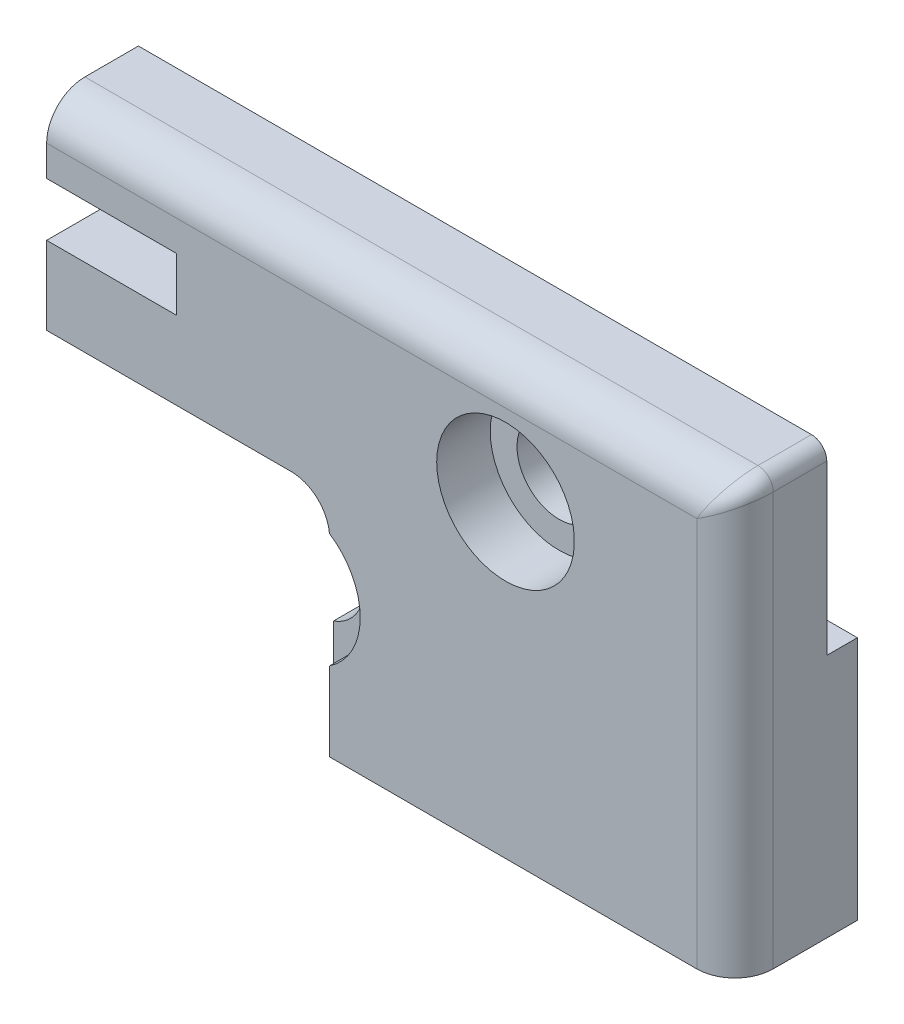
ISO-10303-21;
HEADER;
FILE_DESCRIPTION(('STEP AP214'),'2;1');
FILE_NAME('part.step','',(''),(''),'','','');
FILE_SCHEMA(('AUTOMOTIVE_DESIGN { 1 0 10303 214 1 1 1 1 }'));
ENDSEC;
DATA;
#1=APPLICATION_CONTEXT('core data for automotive mechanical design processes');
#2=APPLICATION_PROTOCOL_DEFINITION('international standard','automotive_design',2000,#1);
#3=PRODUCT_CONTEXT('',#1,'mechanical');
#4=PRODUCT('Part','Part','',(#3));
#5=PRODUCT_RELATED_PRODUCT_CATEGORY('part','',(#4));
#6=PRODUCT_DEFINITION_FORMATION('','',#4);
#7=PRODUCT_DEFINITION_CONTEXT('part definition',#1,'design');
#8=PRODUCT_DEFINITION('design','',#6,#7);
#9=PRODUCT_DEFINITION_SHAPE('','',#8);
#10=(LENGTH_UNIT() NAMED_UNIT(*) SI_UNIT(.MILLI.,.METRE.));
#11=(NAMED_UNIT(*) PLANE_ANGLE_UNIT() SI_UNIT($,.RADIAN.));
#12=(NAMED_UNIT(*) SI_UNIT($,.STERADIAN.) SOLID_ANGLE_UNIT());
#13=UNCERTAINTY_MEASURE_WITH_UNIT(LENGTH_MEASURE(1.E-05),#10,'distance_accuracy_value','');
#14=(GEOMETRIC_REPRESENTATION_CONTEXT(3) GLOBAL_UNCERTAINTY_ASSIGNED_CONTEXT((#13)) GLOBAL_UNIT_ASSIGNED_CONTEXT((#10,
#11,#12)) REPRESENTATION_CONTEXT('',''));
#15=CARTESIAN_POINT('',(0.,0.,0.));
#16=DIRECTION('',(0.,0.,1.));
#17=DIRECTION('',(1.,0.,0.));
#18=AXIS2_PLACEMENT_3D('',#15,#16,#17);
#19=CARTESIAN_POINT('',(0.,-30.0864940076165,2.));
#20=DIRECTION('',(0.,0.,-1.));
#21=DIRECTION('',(0.,1.,0.));
#22=AXIS2_PLACEMENT_3D('',#19,#20,#21);
#23=PLANE('',#22);
#24=DIRECTION('',(-1.,0.,0.));
#25=VECTOR('',#24,1.);
#26=CARTESIAN_POINT('',(0.,-5.75000000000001,2.));
#27=LINE('',#26,#25);
#28=CARTESIAN_POINT('',(10.2088987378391,-5.75000000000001,2.));
#29=VERTEX_POINT('',#28);
#30=CARTESIAN_POINT('',(0.,-5.75000000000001,2.));
#31=VERTEX_POINT('',#30);
#32=EDGE_CURVE('E516',#29,#31,#27,.T.);
#33=ORIENTED_EDGE('',*,*,#32,.T.);
#34=DIRECTION('',(0.,1.,0.));
#35=VECTOR('',#34,1.);
#36=CARTESIAN_POINT('',(0.,-30.0864940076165,2.));
#37=LINE('',#36,#35);
#38=CARTESIAN_POINT('',(0.,-1.74999999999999,2.));
#39=VERTEX_POINT('',#38);
#40=EDGE_CURVE('E47',#31,#39,#37,.T.);
#41=ORIENTED_EDGE('',*,*,#40,.T.);
#42=DIRECTION('',(1.,0.,0.));
#43=VECTOR('',#42,1.);
#44=CARTESIAN_POINT('',(-8.5,-1.75,2.));
#45=LINE('',#44,#43);
#46=CARTESIAN_POINT('',(7.16561914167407,-1.74999999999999,2.));
#47=VERTEX_POINT('',#46);
#48=EDGE_CURVE('E296',#39,#47,#45,.T.);
#49=ORIENTED_EDGE('',*,*,#48,.T.);
#50=CARTESIAN_POINT('',(7.16561914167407,-2.74999999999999,2.));
#51=DIRECTION('',(0.,0.,-1.));
#52=DIRECTION('',(0.,1.,0.));
#53=AXIS2_PLACEMENT_3D('',#50,#51,#52);
#54=CIRCLE('',#53,1.);
#55=CARTESIAN_POINT('',(8.13801595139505,-2.51666666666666,2.));
#56=VERTEX_POINT('',#55);
#57=EDGE_CURVE('E547',#47,#56,#54,.T.);
#58=ORIENTED_EDGE('',*,*,#57,.T.);
#59=CARTESIAN_POINT('',(13.,-1.35000000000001,2.));
#60=DIRECTION('',(0.,0.,-1.));
#61=DIRECTION('',(0.,1.,0.));
#62=AXIS2_PLACEMENT_3D('',#59,#60,#61);
#63=CIRCLE('',#62,5.);
#64=CARTESIAN_POINT('',(9.875,-5.25312374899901,2.));
#65=VERTEX_POINT('',#64);
#66=EDGE_CURVE('E578',#65,#56,#63,.T.);
#67=ORIENTED_EDGE('',*,*,#66,.F.);
#68=CARTESIAN_POINT('',(9.25,-6.03374849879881,2.));
#69=DIRECTION('',(0.,0.,-1.));
#70=DIRECTION('',(0.,1.,0.));
#71=AXIS2_PLACEMENT_3D('',#68,#69,#70);
#72=CIRCLE('',#71,1.);
#73=EDGE_CURVE('E549',#65,#29,#72,.T.);
#74=ORIENTED_EDGE('',*,*,#73,.T.);
#75=EDGE_LOOP('',(#33,#41,#49,#58,#67,#74));
#76=FACE_BOUND('',#75,.T.);
#77=ADVANCED_FACE('F32',(#76),#23,.T.);
#78=CARTESIAN_POINT('',(-16.,-9.35000000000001,0.));
#79=DIRECTION('',(0.,0.,1.));
#80=DIRECTION('',(1.,0.,0.));
#81=AXIS2_PLACEMENT_3D('',#78,#79,#80);
#82=PLANE('',#81);
#83=DIRECTION('',(0.,-1.,0.));
#84=VECTOR('',#83,1.);
#85=CARTESIAN_POINT('',(0.,-9.35000000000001,0.));
#86=LINE('',#85,#84);
#87=CARTESIAN_POINT('',(0.,-5.75000000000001,0.));
#88=VERTEX_POINT('',#87);
#89=CARTESIAN_POINT('',(0.,-6.85,0.));
#90=VERTEX_POINT('',#89);
#91=EDGE_CURVE('E663',#88,#90,#86,.T.);
#92=ORIENTED_EDGE('',*,*,#91,.F.);
#93=DIRECTION('',(-1.,0.,0.));
#94=VECTOR('',#93,1.);
#95=CARTESIAN_POINT('',(0.,-5.75000000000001,0.));
#96=LINE('',#95,#94);
#97=CARTESIAN_POINT('',(10.2088987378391,-5.75000000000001,0.));
#98=VERTEX_POINT('',#97);
#99=EDGE_CURVE('E284',#98,#88,#96,.T.);
#100=ORIENTED_EDGE('',*,*,#99,.F.);
#101=CARTESIAN_POINT('',(9.25,-6.03374849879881,0.));
#102=DIRECTION('',(0.,0.,1.));
#103=DIRECTION('',(1.,0.,0.));
#104=AXIS2_PLACEMENT_3D('',#101,#102,#103);
#105=CIRCLE('',#104,1.);
#106=CARTESIAN_POINT('',(10.25,-6.03374849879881,0.));
#107=VERTEX_POINT('',#106);
#108=EDGE_CURVE('E553',#98,#107,#105,.F.);
#109=ORIENTED_EDGE('',*,*,#108,.T.);
#110=DIRECTION('',(0.,-1.,0.));
#111=VECTOR('',#110,1.);
#112=CARTESIAN_POINT('',(10.25,-9.35000000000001,0.));
#113=LINE('',#112,#111);
#114=CARTESIAN_POINT('',(10.25,-6.85000000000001,0.));
#115=VERTEX_POINT('',#114);
#116=EDGE_CURVE('E585',#107,#115,#113,.T.);
#117=ORIENTED_EDGE('',*,*,#116,.T.);
#118=DIRECTION('',(1.,0.,0.));
#119=VECTOR('',#118,1.);
#120=CARTESIAN_POINT('',(0.,-6.85,0.));
#121=LINE('',#120,#119);
#122=EDGE_CURVE('E303',#90,#115,#121,.T.);
#123=ORIENTED_EDGE('',*,*,#122,.F.);
#124=EDGE_LOOP('',(#92,#100,#109,#117,#123));
#125=FACE_BOUND('',#124,.T.);
#126=ADVANCED_FACE('F372',(#125),#82,.F.);
#127=CARTESIAN_POINT('',(-16.,-9.35000000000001,8.));
#128=DIRECTION('',(0.,0.,1.));
#129=DIRECTION('',(1.,0.,0.));
#130=AXIS2_PLACEMENT_3D('',#127,#128,#129);
#131=PLANE('',#130);
#132=CARTESIAN_POINT('',(30.,-1.55,8.));
#133=DIRECTION('',(0.,0.,-1.));
#134=DIRECTION('',(-1.,0.,0.));
#135=AXIS2_PLACEMENT_3D('',#132,#133,#134);
#136=CIRCLE('',#135,4.5);
#137=CARTESIAN_POINT('',(25.5,-1.55,8.));
#138=VERTEX_POINT('',#137);
#139=EDGE_CURVE('E403',#138,#138,#136,.T.);
#140=ORIENTED_EDGE('',*,*,#139,.T.);
#141=EDGE_LOOP('',(#140));
#142=FACE_BOUND('',#141,.T.);
#143=DIRECTION('',(1.,0.,0.));
#144=VECTOR('',#143,1.);
#145=CARTESIAN_POINT('',(0.,3.75,8.));
#146=LINE('',#145,#144);
#147=CARTESIAN_POINT('',(42.5,3.75,8.));
#148=VERTEX_POINT('',#147);
#149=CARTESIAN_POINT('',(0.,3.75,8.));
#150=VERTEX_POINT('',#149);
#151=EDGE_CURVE('E317',#148,#150,#146,.F.);
#152=ORIENTED_EDGE('',*,*,#151,.T.);
#153=DIRECTION('',(0.,-1.,0.));
#154=VECTOR('',#153,1.);
#155=CARTESIAN_POINT('',(0.,-9.35000000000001,8.));
#156=LINE('',#155,#154);
#157=CARTESIAN_POINT('',(0.,1.75,8.));
#158=VERTEX_POINT('',#157);
#159=EDGE_CURVE('E268',#150,#158,#156,.T.);
#160=ORIENTED_EDGE('',*,*,#159,.T.);
#161=DIRECTION('',(1.,0.,0.));
#162=VECTOR('',#161,1.);
#163=CARTESIAN_POINT('',(0.,1.75,8.));
#164=LINE('',#163,#162);
#165=CARTESIAN_POINT('',(8.5,1.75,8.));
#166=VERTEX_POINT('',#165);
#167=EDGE_CURVE('E306',#158,#166,#164,.T.);
#168=ORIENTED_EDGE('',*,*,#167,.T.);
#169=DIRECTION('',(0.,1.,0.));
#170=VECTOR('',#169,1.);
#171=CARTESIAN_POINT('',(8.5,1.75,8.));
#172=LINE('',#171,#170);
#173=CARTESIAN_POINT('',(8.5,-1.75,8.));
#174=VERTEX_POINT('',#173);
#175=EDGE_CURVE('E473',#174,#166,#172,.T.);
#176=ORIENTED_EDGE('',*,*,#175,.F.);
#177=DIRECTION('',(-1.,0.,0.));
#178=VECTOR('',#177,1.);
#179=CARTESIAN_POINT('',(-8.5,-1.75,8.));
#180=LINE('',#179,#178);
#181=CARTESIAN_POINT('',(0.,-1.75,8.));
#182=VERTEX_POINT('',#181);
#183=EDGE_CURVE('E302',#174,#182,#180,.T.);
#184=ORIENTED_EDGE('',*,*,#183,.T.);
#185=CARTESIAN_POINT('',(0.,-6.85,8.));
#186=VERTEX_POINT('',#185);
#187=EDGE_CURVE('E627',#182,#186,#156,.T.);
#188=ORIENTED_EDGE('',*,*,#187,.T.);
#189=DIRECTION('',(1.,0.,0.));
#190=VECTOR('',#189,1.);
#191=CARTESIAN_POINT('',(0.,-6.85,8.));
#192=LINE('',#191,#190);
#193=CARTESIAN_POINT('',(16.,-6.85,8.));
#194=VERTEX_POINT('',#193);
#195=EDGE_CURVE('E300',#186,#194,#192,.T.);
#196=ORIENTED_EDGE('',*,*,#195,.T.);
#197=CARTESIAN_POINT('',(16.,-9.35000000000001,8.));
#198=DIRECTION('',(0.,0.,1.));
#199=DIRECTION('',(-1.,0.,0.));
#200=AXIS2_PLACEMENT_3D('',#197,#198,#199);
#201=CIRCLE('',#200,2.5);
#202=CARTESIAN_POINT('',(18.4874685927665,-9.1,8.));
#203=VERTEX_POINT('',#202);
#204=EDGE_CURVE('E477',#203,#194,#201,.T.);
#205=ORIENTED_EDGE('',*,*,#204,.F.);
#206=CARTESIAN_POINT('',(16.,-12.85,8.));
#207=DIRECTION('',(0.,0.,-1.));
#208=DIRECTION('',(-1.,0.,0.));
#209=AXIS2_PLACEMENT_3D('',#206,#207,#208);
#210=CIRCLE('',#209,4.5);
#211=CARTESIAN_POINT('',(18.5,-16.5916573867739,8.));
#212=VERTEX_POINT('',#211);
#213=EDGE_CURVE('E440',#203,#212,#210,.T.);
#214=ORIENTED_EDGE('',*,*,#213,.T.);
#215=DIRECTION('',(0.,1.,0.));
#216=VECTOR('',#215,1.);
#217=CARTESIAN_POINT('',(18.5,-18.85,8.));
#218=LINE('',#217,#216);
#219=CARTESIAN_POINT('',(18.5,-21.75,8.));
#220=VERTEX_POINT('',#219);
#221=EDGE_CURVE('E480',#220,#212,#218,.T.);
#222=ORIENTED_EDGE('',*,*,#221,.F.);
#223=DIRECTION('',(-1.,0.,0.));
#224=VECTOR('',#223,1.);
#225=CARTESIAN_POINT('',(18.5,-21.75,8.));
#226=LINE('',#225,#224);
#227=CARTESIAN_POINT('',(42.5,-21.75,8.));
#228=VERTEX_POINT('',#227);
#229=EDGE_CURVE('E471',#228,#220,#226,.T.);
#230=ORIENTED_EDGE('',*,*,#229,.F.);
#231=DIRECTION('',(0.,-1.,0.));
#232=VECTOR('',#231,1.);
#233=CARTESIAN_POINT('',(42.5,-9.35000000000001,8.));
#234=LINE('',#233,#232);
#235=EDGE_CURVE('E315',#228,#148,#234,.F.);
#236=ORIENTED_EDGE('',*,*,#235,.T.);
#237=EDGE_LOOP('',(#152,#160,#168,#176,#184,#188,#196,#205,#214,#222,#230,#236));
#238=FACE_BOUND('',#237,.T.);
#239=ADVANCED_FACE('F378',(#142,#238),#131,.T.);
#240=CARTESIAN_POINT('',(-8.5,-1.75,8.));
#241=DIRECTION('',(0.,-1.,0.));
#242=DIRECTION('',(1.,0.,0.));
#243=AXIS2_PLACEMENT_3D('',#240,#241,#242);
#244=PLANE('',#243);
#245=DIRECTION('',(0.,0.,-1.));
#246=VECTOR('',#245,1.);
#247=CARTESIAN_POINT('',(0.,-1.75,8.));
#248=LINE('',#247,#246);
#249=EDGE_CURVE('E632',#182,#39,#248,.T.);
#250=ORIENTED_EDGE('',*,*,#249,.F.);
#251=ORIENTED_EDGE('',*,*,#183,.F.);
#252=DIRECTION('',(0.,0.,-1.));
#253=VECTOR('',#252,1.);
#254=CARTESIAN_POINT('',(8.5,-1.75,8.));
#255=LINE('',#254,#253);
#256=CARTESIAN_POINT('',(8.5,-1.75,5.8));
#257=VERTEX_POINT('',#256);
#258=EDGE_CURVE('E510',#174,#257,#255,.T.);
#259=ORIENTED_EDGE('',*,*,#258,.T.);
#260=DIRECTION('',(1.,0.,0.));
#261=VECTOR('',#260,1.);
#262=CARTESIAN_POINT('',(-8.5,-1.75,5.8));
#263=LINE('',#262,#261);
#264=CARTESIAN_POINT('',(7.16561914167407,-1.74999999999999,5.8));
#265=VERTEX_POINT('',#264);
#266=EDGE_CURVE('E565',#265,#257,#263,.T.);
#267=ORIENTED_EDGE('',*,*,#266,.F.);
#268=DIRECTION('',(0.,0.,1.));
#269=VECTOR('',#268,1.);
#270=CARTESIAN_POINT('',(7.16561914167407,-1.74999999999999,8.));
#271=LINE('',#270,#269);
#272=EDGE_CURVE('E555',#265,#47,#271,.F.);
#273=ORIENTED_EDGE('',*,*,#272,.T.);
#274=ORIENTED_EDGE('',*,*,#48,.F.);
#275=EDGE_LOOP('',(#250,#251,#259,#267,#273,#274));
#276=FACE_BOUND('',#275,.T.);
#277=ADVANCED_FACE('F396',(#276),#244,.F.);
#278=CARTESIAN_POINT('',(0.,-6.85,8.));
#279=DIRECTION('',(0.,1.,0.));
#280=DIRECTION('',(-1.,0.,0.));
#281=AXIS2_PLACEMENT_3D('',#278,#279,#280);
#282=PLANE('',#281);
#283=DIRECTION('',(0.,0.,1.));
#284=VECTOR('',#283,1.);
#285=CARTESIAN_POINT('',(0.,-6.85,8.));
#286=LINE('',#285,#284);
#287=EDGE_CURVE('E665',#90,#186,#286,.T.);
#288=ORIENTED_EDGE('',*,*,#287,.F.);
#289=ORIENTED_EDGE('',*,*,#122,.T.);
#290=DIRECTION('',(0.,0.,1.));
#291=VECTOR('',#290,1.);
#292=CARTESIAN_POINT('',(10.25,-6.85000000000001,-1.5));
#293=LINE('',#292,#291);
#294=CARTESIAN_POINT('',(10.25,-6.85000000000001,5.8));
#295=VERTEX_POINT('',#294);
#296=EDGE_CURVE('E580',#115,#295,#293,.T.);
#297=ORIENTED_EDGE('',*,*,#296,.T.);
#298=DIRECTION('',(1.,0.,0.));
#299=VECTOR('',#298,1.);
#300=CARTESIAN_POINT('',(15.75,-6.85,5.8));
#301=LINE('',#300,#299);
#302=CARTESIAN_POINT('',(15.75,-6.85,5.8));
#303=VERTEX_POINT('',#302);
#304=EDGE_CURVE('E619',#295,#303,#301,.T.);
#305=ORIENTED_EDGE('',*,*,#304,.T.);
#306=DIRECTION('',(0.,0.,1.));
#307=VECTOR('',#306,1.);
#308=CARTESIAN_POINT('',(15.75,-6.85,-1.5));
#309=LINE('',#308,#307);
#310=CARTESIAN_POINT('',(15.75,-6.85,0.));
#311=VERTEX_POINT('',#310);
#312=EDGE_CURVE('E575',#311,#303,#309,.T.);
#313=ORIENTED_EDGE('',*,*,#312,.F.);
#314=CARTESIAN_POINT('',(16.,-6.85,0.));
#315=VERTEX_POINT('',#314);
#316=EDGE_CURVE('E299',#311,#315,#121,.T.);
#317=ORIENTED_EDGE('',*,*,#316,.T.);
#318=DIRECTION('',(0.,0.,-1.));
#319=VECTOR('',#318,1.);
#320=CARTESIAN_POINT('',(16.,-6.85,8.));
#321=LINE('',#320,#319);
#322=EDGE_CURVE('E507',#194,#315,#321,.T.);
#323=ORIENTED_EDGE('',*,*,#322,.F.);
#324=ORIENTED_EDGE('',*,*,#195,.F.);
#325=EDGE_LOOP('',(#288,#289,#297,#305,#313,#317,#323,#324));
#326=FACE_BOUND('',#325,.T.);
#327=ADVANCED_FACE('F387',(#326),#282,.F.);
#328=CARTESIAN_POINT('',(30.,-1.55,2.));
#329=DIRECTION('',(0.,0.,1.));
#330=DIRECTION('',(0.,-1.,0.));
#331=AXIS2_PLACEMENT_3D('',#328,#329,#330);
#332=CIRCLE('',#331,2.75);
#333=CARTESIAN_POINT('',(30.,-4.3,2.));
#334=VERTEX_POINT('',#333);
#335=EDGE_CURVE('E401',#334,#334,#332,.F.);
#336=ORIENTED_EDGE('',*,*,#335,.F.);
#337=EDGE_LOOP('',(#336));
#338=FACE_BOUND('',#337,.T.);
#339=DIRECTION('',(-1.,0.,0.));
#340=VECTOR('',#339,1.);
#341=CARTESIAN_POINT('',(0.,1.75,2.));
#342=LINE('',#341,#340);
#343=CARTESIAN_POINT('',(8.5,1.75,2.));
#344=VERTEX_POINT('',#343);
#345=CARTESIAN_POINT('',(0.,1.75,2.));
#346=VERTEX_POINT('',#345);
#347=EDGE_CURVE('E276',#344,#346,#342,.T.);
#348=ORIENTED_EDGE('',*,*,#347,.T.);
#349=DIRECTION('',(0.,1.,0.));
#350=VECTOR('',#349,1.);
#351=CARTESIAN_POINT('',(0.,-30.0864940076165,2.));
#352=LINE('',#351,#350);
#353=CARTESIAN_POINT('',(0.,6.25,2.));
#354=VERTEX_POINT('',#353);
#355=EDGE_CURVE('E260',#346,#354,#352,.T.);
#356=ORIENTED_EDGE('',*,*,#355,.T.);
#357=DIRECTION('',(-1.,0.,0.));
#358=VECTOR('',#357,1.);
#359=CARTESIAN_POINT('',(0.,6.24999999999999,2.));
#360=LINE('',#359,#358);
#361=CARTESIAN_POINT('',(44.,6.25,2.));
#362=VERTEX_POINT('',#361);
#363=EDGE_CURVE('E273',#362,#354,#360,.T.);
#364=ORIENTED_EDGE('',*,*,#363,.F.);
#365=CARTESIAN_POINT('',(44.,5.25,2.));
#366=DIRECTION('',(0.,0.,1.));
#367=DIRECTION('',(0.,-1.,0.));
#368=AXIS2_PLACEMENT_3D('',#365,#366,#367);
#369=CIRCLE('',#368,1.);
#370=CARTESIAN_POINT('',(45.,5.25,2.));
#371=VERTEX_POINT('',#370);
#372=EDGE_CURVE('E327',#362,#371,#369,.F.);
#373=ORIENTED_EDGE('',*,*,#372,.T.);
#374=DIRECTION('',(0.,-1.,0.));
#375=VECTOR('',#374,1.);
#376=CARTESIAN_POINT('',(45.,-30.0864940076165,2.));
#377=LINE('',#376,#375);
#378=CARTESIAN_POINT('',(45.,-5.75000000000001,2.));
#379=VERTEX_POINT('',#378);
#380=EDGE_CURVE('E410',#371,#379,#377,.T.);
#381=ORIENTED_EDGE('',*,*,#380,.T.);
#382=CARTESIAN_POINT('',(15.7911012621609,-5.75000000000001,2.));
#383=VERTEX_POINT('',#382);
#384=EDGE_CURVE('E297',#379,#383,#27,.T.);
#385=ORIENTED_EDGE('',*,*,#384,.T.);
#386=CARTESIAN_POINT('',(16.75,-6.0337484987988,2.));
#387=DIRECTION('',(0.,0.,-1.));
#388=DIRECTION('',(0.,1.,0.));
#389=AXIS2_PLACEMENT_3D('',#386,#387,#388);
#390=CIRCLE('',#389,1.);
#391=CARTESIAN_POINT('',(16.125,-5.25312374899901,2.));
#392=VERTEX_POINT('',#391);
#393=EDGE_CURVE('E531',#383,#392,#390,.T.);
#394=ORIENTED_EDGE('',*,*,#393,.T.);
#395=CARTESIAN_POINT('',(9.34444904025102,2.06129699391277,2.));
#396=VERTEX_POINT('',#395);
#397=EDGE_CURVE('E574',#396,#392,#63,.T.);
#398=ORIENTED_EDGE('',*,*,#397,.F.);
#399=CARTESIAN_POINT('',(8.61333884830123,2.74355639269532,2.));
#400=DIRECTION('',(0.,0.,-1.));
#401=DIRECTION('',(0.,1.,0.));
#402=AXIS2_PLACEMENT_3D('',#399,#400,#401);
#403=CIRCLE('',#402,1.);
#404=EDGE_CURVE('E532',#396,#344,#403,.T.);
#405=ORIENTED_EDGE('',*,*,#404,.T.);
#406=EDGE_LOOP('',(#348,#356,#364,#373,#381,#385,#394,#398,#405));
#407=FACE_BOUND('',#406,.T.);
#408=ADVANCED_FACE('F272',(#338,#407),#23,.T.);
#409=CARTESIAN_POINT('',(0.,-5.75000000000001,2.75));
#410=DIRECTION('',(0.,-1.,0.));
#411=DIRECTION('',(0.,0.,-1.));
#412=AXIS2_PLACEMENT_3D('',#409,#410,#411);
#413=PLANE('',#412);
#414=DIRECTION('',(0.,0.,-1.));
#415=VECTOR('',#414,1.);
#416=CARTESIAN_POINT('',(0.,-5.75000000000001,2.75));
#417=LINE('',#416,#415);
#418=EDGE_CURVE('E277',#31,#88,#417,.T.);
#419=ORIENTED_EDGE('',*,*,#418,.F.);
#420=ORIENTED_EDGE('',*,*,#32,.F.);
#421=DIRECTION('',(0.,0.,1.));
#422=VECTOR('',#421,1.);
#423=CARTESIAN_POINT('',(10.2088987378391,-5.75000000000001,2.));
#424=LINE('',#423,#422);
#425=EDGE_CURVE('E551',#29,#98,#424,.F.);
#426=ORIENTED_EDGE('',*,*,#425,.T.);
#427=ORIENTED_EDGE('',*,*,#99,.T.);
#428=EDGE_LOOP('',(#419,#420,#426,#427));
#429=FACE_BOUND('',#428,.T.);
#430=ADVANCED_FACE('F386',(#429),#413,.F.);
#431=CARTESIAN_POINT('',(0.,1.75,8.));
#432=DIRECTION('',(0.,1.,0.));
#433=DIRECTION('',(0.,0.,1.));
#434=AXIS2_PLACEMENT_3D('',#431,#432,#433);
#435=PLANE('',#434);
#436=DIRECTION('',(0.,0.,1.));
#437=VECTOR('',#436,1.);
#438=CARTESIAN_POINT('',(0.,1.75,8.));
#439=LINE('',#438,#437);
#440=EDGE_CURVE('E278',#346,#158,#439,.T.);
#441=ORIENTED_EDGE('',*,*,#440,.F.);
#442=ORIENTED_EDGE('',*,*,#347,.F.);
#443=DIRECTION('',(0.,0.,-1.));
#444=VECTOR('',#443,1.);
#445=CARTESIAN_POINT('',(8.5,1.75,8.));
#446=LINE('',#445,#444);
#447=CARTESIAN_POINT('',(8.5,1.75,5.8));
#448=VERTEX_POINT('',#447);
#449=EDGE_CURVE('E513',#448,#344,#446,.T.);
#450=ORIENTED_EDGE('',*,*,#449,.F.);
#451=EDGE_CURVE('E291',#166,#448,#446,.T.);
#452=ORIENTED_EDGE('',*,*,#451,.F.);
#453=ORIENTED_EDGE('',*,*,#167,.F.);
#454=EDGE_LOOP('',(#441,#442,#450,#452,#453));
#455=FACE_BOUND('',#454,.T.);
#456=ADVANCED_FACE('F393',(#455),#435,.F.);
#457=CARTESIAN_POINT('',(-45.,6.25,8.));
#458=DIRECTION('',(0.,-1.,0.));
#459=DIRECTION('',(1.,0.,0.));
#460=AXIS2_PLACEMENT_3D('',#457,#458,#459);
#461=PLANE('',#460);
#462=DIRECTION('',(0.,0.,1.));
#463=VECTOR('',#462,1.);
#464=CARTESIAN_POINT('',(0.,6.25,-12.9306053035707));
#465=LINE('',#464,#463);
#466=CARTESIAN_POINT('',(0.,6.25,5.5));
#467=VERTEX_POINT('',#466);
#468=EDGE_CURVE('E257',#354,#467,#465,.T.);
#469=ORIENTED_EDGE('',*,*,#468,.T.);
#470=DIRECTION('',(1.,0.,0.));
#471=VECTOR('',#470,1.);
#472=CARTESIAN_POINT('',(44.,6.25,5.5));
#473=LINE('',#472,#471);
#474=CARTESIAN_POINT('',(44.,6.25,5.5));
#475=VERTEX_POINT('',#474);
#476=EDGE_CURVE('E313',#467,#475,#473,.T.);
#477=ORIENTED_EDGE('',*,*,#476,.T.);
#478=DIRECTION('',(0.,0.,-1.));
#479=VECTOR('',#478,1.);
#480=CARTESIAN_POINT('',(44.,6.25,0.));
#481=LINE('',#480,#479);
#482=EDGE_CURVE('E283',#475,#362,#481,.T.);
#483=ORIENTED_EDGE('',*,*,#482,.T.);
#484=ORIENTED_EDGE('',*,*,#363,.T.);
#485=EDGE_LOOP('',(#469,#477,#483,#484));
#486=FACE_BOUND('',#485,.T.);
#487=ADVANCED_FACE('F281',(#486),#461,.F.);
#488=DIRECTION('',(0.,1.,0.));
#489=VECTOR('',#488,1.);
#490=CARTESIAN_POINT('',(15.75,-9.35000000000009,0.));
#491=LINE('',#490,#489);
#492=CARTESIAN_POINT('',(15.75,-6.0337484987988,0.));
#493=VERTEX_POINT('',#492);
#494=EDGE_CURVE('E588',#311,#493,#491,.T.);
#495=ORIENTED_EDGE('',*,*,#494,.T.);
#496=CARTESIAN_POINT('',(16.75,-6.0337484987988,0.));
#497=DIRECTION('',(0.,0.,1.));
#498=DIRECTION('',(1.,0.,0.));
#499=AXIS2_PLACEMENT_3D('',#496,#497,#498);
#500=CIRCLE('',#499,1.);
#501=CARTESIAN_POINT('',(15.7911012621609,-5.75000000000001,0.));
#502=VERTEX_POINT('',#501);
#503=EDGE_CURVE('E529',#493,#502,#500,.F.);
#504=ORIENTED_EDGE('',*,*,#503,.T.);
#505=CARTESIAN_POINT('',(45.,-5.75000000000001,0.));
#506=VERTEX_POINT('',#505);
#507=EDGE_CURVE('E288',#506,#502,#96,.T.);
#508=ORIENTED_EDGE('',*,*,#507,.F.);
#509=DIRECTION('',(0.,-1.,0.));
#510=VECTOR('',#509,1.);
#511=CARTESIAN_POINT('',(45.,-21.75,0.));
#512=LINE('',#511,#510);
#513=CARTESIAN_POINT('',(45.,-21.75,0.));
#514=VERTEX_POINT('',#513);
#515=EDGE_CURVE('E485',#506,#514,#512,.T.);
#516=ORIENTED_EDGE('',*,*,#515,.T.);
#517=DIRECTION('',(-1.,0.,0.));
#518=VECTOR('',#517,1.);
#519=CARTESIAN_POINT('',(18.5,-21.75,0.));
#520=LINE('',#519,#518);
#521=CARTESIAN_POINT('',(18.5,-21.75,0.));
#522=VERTEX_POINT('',#521);
#523=EDGE_CURVE('E468',#514,#522,#520,.T.);
#524=ORIENTED_EDGE('',*,*,#523,.T.);
#525=DIRECTION('',(0.,1.,0.));
#526=VECTOR('',#525,1.);
#527=CARTESIAN_POINT('',(18.5,-18.85,0.));
#528=LINE('',#527,#526);
#529=CARTESIAN_POINT('',(18.5,-16.5916573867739,0.));
#530=VERTEX_POINT('',#529);
#531=EDGE_CURVE('E474',#522,#530,#528,.T.);
#532=ORIENTED_EDGE('',*,*,#531,.T.);
#533=CARTESIAN_POINT('',(16.,-12.85,0.));
#534=DIRECTION('',(0.,0.,1.));
#535=DIRECTION('',(1.,0.,0.));
#536=AXIS2_PLACEMENT_3D('',#533,#534,#535);
#537=CIRCLE('',#536,4.5);
#538=CARTESIAN_POINT('',(18.4874685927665,-9.1,0.));
#539=VERTEX_POINT('',#538);
#540=EDGE_CURVE('E334',#530,#539,#537,.T.);
#541=ORIENTED_EDGE('',*,*,#540,.T.);
#542=CARTESIAN_POINT('',(16.,-9.35000000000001,0.));
#543=DIRECTION('',(0.,0.,1.));
#544=DIRECTION('',(-1.,0.,0.));
#545=AXIS2_PLACEMENT_3D('',#542,#543,#544);
#546=CIRCLE('',#545,2.5);
#547=EDGE_CURVE('E487',#539,#315,#546,.T.);
#548=ORIENTED_EDGE('',*,*,#547,.T.);
#549=ORIENTED_EDGE('',*,*,#316,.F.);
#550=EDGE_LOOP('',(#495,#504,#508,#516,#524,#532,#541,#548,#549));
#551=FACE_BOUND('',#550,.T.);
#552=ADVANCED_FACE('F381',(#551),#82,.F.);
#553=ORIENTED_EDGE('',*,*,#507,.T.);
#554=DIRECTION('',(0.,0.,1.));
#555=VECTOR('',#554,1.);
#556=CARTESIAN_POINT('',(15.7911012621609,-5.75000000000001,0.));
#557=LINE('',#556,#555);
#558=EDGE_CURVE('E524',#502,#383,#557,.T.);
#559=ORIENTED_EDGE('',*,*,#558,.T.);
#560=ORIENTED_EDGE('',*,*,#384,.F.);
#561=DIRECTION('',(0.,0.,1.));
#562=VECTOR('',#561,1.);
#563=CARTESIAN_POINT('',(45.,-5.75000000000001,2.75));
#564=LINE('',#563,#562);
#565=EDGE_CURVE('E404',#506,#379,#564,.T.);
#566=ORIENTED_EDGE('',*,*,#565,.F.);
#567=EDGE_LOOP('',(#553,#559,#560,#566));
#568=FACE_BOUND('',#567,.T.);
#569=ADVANCED_FACE('F395',(#568),#413,.F.);
#570=CARTESIAN_POINT('',(30.,-1.55,8.));
#571=DIRECTION('',(0.,0.,-1.));
#572=DIRECTION('',(-1.,0.,0.));
#573=AXIS2_PLACEMENT_3D('',#570,#571,#572);
#574=CYLINDRICAL_SURFACE('',#573,2.75);
#575=ORIENTED_EDGE('',*,*,#335,.T.);
#576=EDGE_LOOP('',(#575));
#577=FACE_BOUND('',#576,.T.);
#578=CARTESIAN_POINT('',(30.,-1.55,4.5));
#579=DIRECTION('',(0.,0.,1.));
#580=DIRECTION('',(1.,0.,0.));
#581=AXIS2_PLACEMENT_3D('',#578,#579,#580);
#582=CIRCLE('',#581,2.75);
#583=CARTESIAN_POINT('',(32.75,-1.55,4.5));
#584=VERTEX_POINT('',#583);
#585=EDGE_CURVE('E331',#584,#584,#582,.F.);
#586=ORIENTED_EDGE('',*,*,#585,.F.);
#587=EDGE_LOOP('',(#586));
#588=FACE_BOUND('',#587,.T.);
#589=ADVANCED_FACE('F713',(#577,#588),#574,.F.);
#590=CARTESIAN_POINT('',(17.,-7.05871215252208,8.));
#591=DIRECTION('',(-1.,0.,0.));
#592=DIRECTION('',(0.,-1.,0.));
#593=AXIS2_PLACEMENT_3D('',#590,#591,#592);
#594=PLANE('',#593);
#595=DIRECTION('',(0.,0.,-1.));
#596=VECTOR('',#595,1.);
#597=CARTESIAN_POINT('',(17.,-7.05871215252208,8.));
#598=LINE('',#597,#596);
#599=CARTESIAN_POINT('',(17.,-7.05871215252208,6.25));
#600=VERTEX_POINT('',#599);
#601=CARTESIAN_POINT('',(17.,-7.05871215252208,2.25));
#602=VERTEX_POINT('',#601);
#603=EDGE_CURVE('E504',#600,#602,#598,.T.);
#604=ORIENTED_EDGE('',*,*,#603,.T.);
#605=DIRECTION('',(0.,-1.,0.));
#606=VECTOR('',#605,1.);
#607=CARTESIAN_POINT('',(17.,-7.05871215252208,2.25));
#608=LINE('',#607,#606);
#609=CARTESIAN_POINT('',(17.,-10.0215728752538,2.25));
#610=VERTEX_POINT('',#609);
#611=EDGE_CURVE('E419',#602,#610,#608,.T.);
#612=ORIENTED_EDGE('',*,*,#611,.T.);
#613=DIRECTION('',(0.,0.,-1.));
#614=VECTOR('',#613,1.);
#615=CARTESIAN_POINT('',(17.,-10.0215728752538,8.));
#616=LINE('',#615,#614);
#617=CARTESIAN_POINT('',(17.,-10.0215728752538,6.25));
#618=VERTEX_POINT('',#617);
#619=EDGE_CURVE('E501',#618,#610,#616,.T.);
#620=ORIENTED_EDGE('',*,*,#619,.F.);
#621=DIRECTION('',(0.,1.,0.));
#622=VECTOR('',#621,1.);
#623=CARTESIAN_POINT('',(16.9999999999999,-54.3676167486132,6.25));
#624=LINE('',#623,#622);
#625=EDGE_CURVE('E443',#618,#600,#624,.T.);
#626=ORIENTED_EDGE('',*,*,#625,.T.);
#627=EDGE_LOOP('',(#604,#612,#620,#626));
#628=FACE_BOUND('',#627,.T.);
#629=ADVANCED_FACE('F716',(#628),#594,.T.);
#630=CARTESIAN_POINT('',(16.,-12.85,8.));
#631=DIRECTION('',(0.,0.,-1.));
#632=DIRECTION('',(-1.,0.,0.));
#633=AXIS2_PLACEMENT_3D('',#630,#631,#632);
#634=CYLINDRICAL_SURFACE('',#633,3.);
#635=ORIENTED_EDGE('',*,*,#619,.T.);
#636=CARTESIAN_POINT('',(16.,-12.85,2.25));
#637=DIRECTION('',(0.,0.,-1.));
#638=DIRECTION('',(1.,0.,0.));
#639=AXIS2_PLACEMENT_3D('',#636,#637,#638);
#640=CIRCLE('',#639,3.);
#641=CARTESIAN_POINT('',(17.,-15.6784271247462,2.25));
#642=VERTEX_POINT('',#641);
#643=EDGE_CURVE('E416',#610,#642,#640,.T.);
#644=ORIENTED_EDGE('',*,*,#643,.T.);
#645=DIRECTION('',(0.,0.,-1.));
#646=VECTOR('',#645,1.);
#647=CARTESIAN_POINT('',(17.,-15.6784271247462,8.));
#648=LINE('',#647,#646);
#649=CARTESIAN_POINT('',(17.,-15.6784271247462,6.25));
#650=VERTEX_POINT('',#649);
#651=EDGE_CURVE('E498',#650,#642,#648,.T.);
#652=ORIENTED_EDGE('',*,*,#651,.F.);
#653=CARTESIAN_POINT('',(16.,-12.85,6.25));
#654=DIRECTION('',(0.,0.,-1.));
#655=DIRECTION('',(-1.,0.,0.));
#656=AXIS2_PLACEMENT_3D('',#653,#654,#655);
#657=CIRCLE('',#656,3.);
#658=EDGE_CURVE('E446',#650,#618,#657,.F.);
#659=ORIENTED_EDGE('',*,*,#658,.T.);
#660=EDGE_LOOP('',(#635,#644,#652,#659));
#661=FACE_BOUND('',#660,.T.);
#662=ADVANCED_FACE('F727',(#661),#634,.F.);
#663=CARTESIAN_POINT('',(17.,-15.6784271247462,8.));
#664=DIRECTION('',(-1.,0.,0.));
#665=DIRECTION('',(0.,0.,1.));
#666=AXIS2_PLACEMENT_3D('',#663,#664,#665);
#667=PLANE('',#666);
#668=ORIENTED_EDGE('',*,*,#651,.T.);
#669=DIRECTION('',(0.,-1.,0.));
#670=VECTOR('',#669,1.);
#671=CARTESIAN_POINT('',(17.,-15.6784271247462,2.25));
#672=LINE('',#671,#670);
#673=CARTESIAN_POINT('',(17.,-18.85,2.25));
#674=VERTEX_POINT('',#673);
#675=EDGE_CURVE('E431',#642,#674,#672,.T.);
#676=ORIENTED_EDGE('',*,*,#675,.T.);
#677=DIRECTION('',(0.,0.,-1.));
#678=VECTOR('',#677,1.);
#679=CARTESIAN_POINT('',(17.,-18.85,8.));
#680=LINE('',#679,#678);
#681=CARTESIAN_POINT('',(17.,-18.85,6.25));
#682=VERTEX_POINT('',#681);
#683=EDGE_CURVE('E495',#682,#674,#680,.T.);
#684=ORIENTED_EDGE('',*,*,#683,.F.);
#685=DIRECTION('',(0.,1.,0.));
#686=VECTOR('',#685,1.);
#687=CARTESIAN_POINT('',(17.,-54.3676167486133,6.25));
#688=LINE('',#687,#686);
#689=EDGE_CURVE('E449',#682,#650,#688,.T.);
#690=ORIENTED_EDGE('',*,*,#689,.T.);
#691=EDGE_LOOP('',(#668,#676,#684,#690));
#692=FACE_BOUND('',#691,.T.);
#693=ADVANCED_FACE('F723',(#692),#667,.T.);
#694=CARTESIAN_POINT('',(17.,-18.85,8.));
#695=DIRECTION('',(0.,-1.,0.));
#696=DIRECTION('',(0.,0.,-1.));
#697=AXIS2_PLACEMENT_3D('',#694,#695,#696);
#698=PLANE('',#697);
#699=ORIENTED_EDGE('',*,*,#683,.T.);
#700=DIRECTION('',(1.,0.,0.));
#701=VECTOR('',#700,1.);
#702=CARTESIAN_POINT('',(17.,-18.85,2.25));
#703=LINE('',#702,#701);
#704=CARTESIAN_POINT('',(18.5,-18.85,2.25));
#705=VERTEX_POINT('',#704);
#706=EDGE_CURVE('E428',#674,#705,#703,.T.);
#707=ORIENTED_EDGE('',*,*,#706,.T.);
#708=DIRECTION('',(0.,0.,-1.));
#709=VECTOR('',#708,1.);
#710=CARTESIAN_POINT('',(18.5,-18.85,8.));
#711=LINE('',#710,#709);
#712=CARTESIAN_POINT('',(18.5,-18.85,6.25));
#713=VERTEX_POINT('',#712);
#714=EDGE_CURVE('E492',#713,#705,#711,.T.);
#715=ORIENTED_EDGE('',*,*,#714,.F.);
#716=DIRECTION('',(-1.,0.,0.));
#717=VECTOR('',#716,1.);
#718=CARTESIAN_POINT('',(29.4750790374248,-18.85,6.25));
#719=LINE('',#718,#717);
#720=EDGE_CURVE('E452',#713,#682,#719,.T.);
#721=ORIENTED_EDGE('',*,*,#720,.T.);
#722=EDGE_LOOP('',(#699,#707,#715,#721));
#723=FACE_BOUND('',#722,.T.);
#724=ADVANCED_FACE('F719',(#723),#698,.T.);
#725=CARTESIAN_POINT('',(18.5,-21.75,8.));
#726=DIRECTION('',(0.,-1.,0.));
#727=DIRECTION('',(1.,0.,0.));
#728=AXIS2_PLACEMENT_3D('',#725,#726,#727);
#729=PLANE('',#728);
#730=DIRECTION('',(0.,0.,-1.));
#731=VECTOR('',#730,1.);
#732=CARTESIAN_POINT('',(45.,-21.75,8.));
#733=LINE('',#732,#731);
#734=CARTESIAN_POINT('',(45.,-21.75,5.5));
#735=VERTEX_POINT('',#734);
#736=EDGE_CURVE('E285',#735,#514,#733,.T.);
#737=ORIENTED_EDGE('',*,*,#736,.F.);
#738=CARTESIAN_POINT('',(42.5,-21.75,5.5));
#739=DIRECTION('',(0.,-1.,0.));
#740=DIRECTION('',(1.,0.,0.));
#741=AXIS2_PLACEMENT_3D('',#738,#739,#740);
#742=CIRCLE('',#741,2.5);
#743=EDGE_CURVE('E325',#735,#228,#742,.T.);
#744=ORIENTED_EDGE('',*,*,#743,.T.);
#745=ORIENTED_EDGE('',*,*,#229,.T.);
#746=DIRECTION('',(0.,0.,-1.));
#747=VECTOR('',#746,1.);
#748=CARTESIAN_POINT('',(18.5,-21.75,8.));
#749=LINE('',#748,#747);
#750=EDGE_CURVE('E482',#220,#522,#749,.T.);
#751=ORIENTED_EDGE('',*,*,#750,.T.);
#752=ORIENTED_EDGE('',*,*,#523,.F.);
#753=EDGE_LOOP('',(#737,#744,#745,#751,#752));
#754=FACE_BOUND('',#753,.T.);
#755=ADVANCED_FACE('F722',(#754),#729,.T.);
#756=CARTESIAN_POINT('',(45.,-21.75,8.));
#757=DIRECTION('',(1.,0.,0.));
#758=DIRECTION('',(0.,0.,-1.));
#759=AXIS2_PLACEMENT_3D('',#756,#757,#758);
#760=PLANE('',#759);
#761=ORIENTED_EDGE('',*,*,#380,.F.);
#762=DIRECTION('',(0.,0.,-1.));
#763=VECTOR('',#762,1.);
#764=CARTESIAN_POINT('',(45.,5.25,8.));
#765=LINE('',#764,#763);
#766=CARTESIAN_POINT('',(45.,5.25,5.5));
#767=VERTEX_POINT('',#766);
#768=EDGE_CURVE('E311',#371,#767,#765,.F.);
#769=ORIENTED_EDGE('',*,*,#768,.T.);
#770=DIRECTION('',(0.,-1.,0.));
#771=VECTOR('',#770,1.);
#772=CARTESIAN_POINT('',(45.,-21.75,5.5));
#773=LINE('',#772,#771);
#774=EDGE_CURVE('E323',#767,#735,#773,.T.);
#775=ORIENTED_EDGE('',*,*,#774,.T.);
#776=ORIENTED_EDGE('',*,*,#736,.T.);
#777=ORIENTED_EDGE('',*,*,#515,.F.);
#778=ORIENTED_EDGE('',*,*,#565,.T.);
#779=EDGE_LOOP('',(#761,#769,#775,#776,#777,#778));
#780=FACE_BOUND('',#779,.T.);
#781=ADVANCED_FACE('F593',(#780),#760,.T.);
#782=CARTESIAN_POINT('',(8.5,1.75,8.));
#783=DIRECTION('',(-1.,0.,0.));
#784=DIRECTION('',(0.,0.,1.));
#785=AXIS2_PLACEMENT_3D('',#782,#783,#784);
#786=PLANE('',#785);
#787=ORIENTED_EDGE('',*,*,#451,.T.);
#788=DIRECTION('',(0.,-1.,0.));
#789=VECTOR('',#788,1.);
#790=CARTESIAN_POINT('',(8.5,1.75,5.8));
#791=LINE('',#790,#789);
#792=EDGE_CURVE('E54',#448,#257,#791,.T.);
#793=ORIENTED_EDGE('',*,*,#792,.T.);
#794=ORIENTED_EDGE('',*,*,#258,.F.);
#795=ORIENTED_EDGE('',*,*,#175,.T.);
#796=EDGE_LOOP('',(#787,#793,#794,#795));
#797=FACE_BOUND('',#796,.T.);
#798=ADVANCED_FACE('F654',(#797),#786,.T.);
#799=CARTESIAN_POINT('',(16.,-9.35000000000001,8.));
#800=DIRECTION('',(0.,0.,-1.));
#801=DIRECTION('',(-1.,0.,0.));
#802=AXIS2_PLACEMENT_3D('',#799,#800,#801);
#803=CYLINDRICAL_SURFACE('',#802,2.5);
#804=ORIENTED_EDGE('',*,*,#547,.F.);
#805=DIRECTION('',(0.,0.,-1.));
#806=VECTOR('',#805,1.);
#807=CARTESIAN_POINT('',(18.4874685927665,-9.1,2.25));
#808=LINE('',#807,#806);
#809=CARTESIAN_POINT('',(18.4874685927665,-9.1,2.25));
#810=VERTEX_POINT('',#809);
#811=EDGE_CURVE('E434',#810,#539,#808,.T.);
#812=ORIENTED_EDGE('',*,*,#811,.F.);
#813=CARTESIAN_POINT('',(16.,-9.35000000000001,2.25));
#814=DIRECTION('',(0.,0.,1.));
#815=DIRECTION('',(1.,0.,0.));
#816=AXIS2_PLACEMENT_3D('',#813,#814,#815);
#817=CIRCLE('',#816,2.5);
#818=EDGE_CURVE('E422',#810,#602,#817,.T.);
#819=ORIENTED_EDGE('',*,*,#818,.T.);
#820=ORIENTED_EDGE('',*,*,#603,.F.);
#821=CARTESIAN_POINT('',(16.,-9.35000000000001,6.25));
#822=DIRECTION('',(0.,0.,-1.));
#823=DIRECTION('',(-1.,0.,0.));
#824=AXIS2_PLACEMENT_3D('',#821,#822,#823);
#825=CIRCLE('',#824,2.5);
#826=CARTESIAN_POINT('',(18.4874685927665,-9.1,6.25));
#827=VERTEX_POINT('',#826);
#828=EDGE_CURVE('E460',#600,#827,#825,.T.);
#829=ORIENTED_EDGE('',*,*,#828,.T.);
#830=DIRECTION('',(0.,0.,1.));
#831=VECTOR('',#830,1.);
#832=CARTESIAN_POINT('',(18.4874685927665,-9.1,6.25));
#833=LINE('',#832,#831);
#834=EDGE_CURVE('E465',#827,#203,#833,.T.);
#835=ORIENTED_EDGE('',*,*,#834,.T.);
#836=ORIENTED_EDGE('',*,*,#204,.T.);
#837=ORIENTED_EDGE('',*,*,#322,.T.);
#838=EDGE_LOOP('',(#804,#812,#819,#820,#829,#835,#836,#837));
#839=FACE_BOUND('',#838,.T.);
#840=ADVANCED_FACE('F610',(#839),#803,.F.);
#841=CARTESIAN_POINT('',(18.5,-18.85,8.));
#842=DIRECTION('',(-1.,0.,0.));
#843=DIRECTION('',(0.,-1.,0.));
#844=AXIS2_PLACEMENT_3D('',#841,#842,#843);
#845=PLANE('',#844);
#846=ORIENTED_EDGE('',*,*,#531,.F.);
#847=ORIENTED_EDGE('',*,*,#750,.F.);
#848=ORIENTED_EDGE('',*,*,#221,.T.);
#849=DIRECTION('',(0.,0.,1.));
#850=VECTOR('',#849,1.);
#851=CARTESIAN_POINT('',(18.5,-16.5916573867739,6.25));
#852=LINE('',#851,#850);
#853=CARTESIAN_POINT('',(18.5,-16.5916573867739,6.25));
#854=VERTEX_POINT('',#853);
#855=EDGE_CURVE('E462',#854,#212,#852,.T.);
#856=ORIENTED_EDGE('',*,*,#855,.F.);
#857=DIRECTION('',(0.,1.,0.));
#858=VECTOR('',#857,1.);
#859=CARTESIAN_POINT('',(18.5,-54.3676167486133,6.25));
#860=LINE('',#859,#858);
#861=EDGE_CURVE('E455',#713,#854,#860,.T.);
#862=ORIENTED_EDGE('',*,*,#861,.F.);
#863=ORIENTED_EDGE('',*,*,#714,.T.);
#864=DIRECTION('',(0.,1.,0.));
#865=VECTOR('',#864,1.);
#866=CARTESIAN_POINT('',(18.5,-18.85,2.25));
#867=LINE('',#866,#865);
#868=CARTESIAN_POINT('',(18.5,-16.5916573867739,2.25));
#869=VERTEX_POINT('',#868);
#870=EDGE_CURVE('E426',#705,#869,#867,.T.);
#871=ORIENTED_EDGE('',*,*,#870,.T.);
#872=DIRECTION('',(0.,0.,-1.));
#873=VECTOR('',#872,1.);
#874=CARTESIAN_POINT('',(18.5,-16.5916573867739,2.25));
#875=LINE('',#874,#873);
#876=EDGE_CURVE('E437',#869,#530,#875,.T.);
#877=ORIENTED_EDGE('',*,*,#876,.T.);
#878=EDGE_LOOP('',(#846,#847,#848,#856,#862,#863,#871,#877));
#879=FACE_BOUND('',#878,.T.);
#880=ADVANCED_FACE('F600',(#879),#845,.T.);
#881=CARTESIAN_POINT('',(16.,-12.85,6.25));
#882=DIRECTION('',(0.,0.,1.));
#883=DIRECTION('',(1.,0.,0.));
#884=AXIS2_PLACEMENT_3D('',#881,#882,#883);
#885=CYLINDRICAL_SURFACE('',#884,4.5);
#886=ORIENTED_EDGE('',*,*,#213,.F.);
#887=ORIENTED_EDGE('',*,*,#834,.F.);
#888=CARTESIAN_POINT('',(16.,-12.85,6.25));
#889=DIRECTION('',(0.,0.,-1.));
#890=DIRECTION('',(-1.,0.,0.));
#891=AXIS2_PLACEMENT_3D('',#888,#889,#890);
#892=CIRCLE('',#891,4.5);
#893=EDGE_CURVE('E458',#827,#854,#892,.T.);
#894=ORIENTED_EDGE('',*,*,#893,.T.);
#895=ORIENTED_EDGE('',*,*,#855,.T.);
#896=EDGE_LOOP('',(#886,#887,#894,#895));
#897=FACE_BOUND('',#896,.T.);
#898=ADVANCED_FACE('F708',(#897),#885,.F.);
#899=CARTESIAN_POINT('',(29.4750790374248,-54.3676167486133,6.25));
#900=DIRECTION('',(0.,0.,1.));
#901=DIRECTION('',(-1.,0.,0.));
#902=AXIS2_PLACEMENT_3D('',#899,#900,#901);
#903=PLANE('',#902);
#904=ORIENTED_EDGE('',*,*,#625,.F.);
#905=ORIENTED_EDGE('',*,*,#658,.F.);
#906=ORIENTED_EDGE('',*,*,#689,.F.);
#907=ORIENTED_EDGE('',*,*,#720,.F.);
#908=ORIENTED_EDGE('',*,*,#861,.T.);
#909=ORIENTED_EDGE('',*,*,#893,.F.);
#910=ORIENTED_EDGE('',*,*,#828,.F.);
#911=EDGE_LOOP('',(#904,#905,#906,#907,#908,#909,#910));
#912=FACE_BOUND('',#911,.T.);
#913=ADVANCED_FACE('F705',(#912),#903,.T.);
#914=CARTESIAN_POINT('',(16.,-12.85,2.25));
#915=DIRECTION('',(0.,0.,-1.));
#916=DIRECTION('',(-1.,0.,0.));
#917=AXIS2_PLACEMENT_3D('',#914,#915,#916);
#918=CYLINDRICAL_SURFACE('',#917,4.5);
#919=ORIENTED_EDGE('',*,*,#540,.F.);
#920=ORIENTED_EDGE('',*,*,#876,.F.);
#921=CARTESIAN_POINT('',(16.,-12.85,2.25));
#922=DIRECTION('',(0.,0.,1.));
#923=DIRECTION('',(1.,0.,0.));
#924=AXIS2_PLACEMENT_3D('',#921,#922,#923);
#925=CIRCLE('',#924,4.5);
#926=EDGE_CURVE('E424',#869,#810,#925,.T.);
#927=ORIENTED_EDGE('',*,*,#926,.T.);
#928=ORIENTED_EDGE('',*,*,#811,.T.);
#929=EDGE_LOOP('',(#919,#920,#927,#928));
#930=FACE_BOUND('',#929,.T.);
#931=ADVANCED_FACE('F606',(#930),#918,.F.);
#932=CARTESIAN_POINT('',(16.,-12.85,2.25));
#933=DIRECTION('',(0.,0.,-1.));
#934=DIRECTION('',(1.,0.,0.));
#935=AXIS2_PLACEMENT_3D('',#932,#933,#934);
#936=PLANE('',#935);
#937=ORIENTED_EDGE('',*,*,#643,.F.);
#938=ORIENTED_EDGE('',*,*,#611,.F.);
#939=ORIENTED_EDGE('',*,*,#818,.F.);
#940=ORIENTED_EDGE('',*,*,#926,.F.);
#941=ORIENTED_EDGE('',*,*,#870,.F.);
#942=ORIENTED_EDGE('',*,*,#706,.F.);
#943=ORIENTED_EDGE('',*,*,#675,.F.);
#944=EDGE_LOOP('',(#937,#938,#939,#940,#941,#942,#943));
#945=FACE_BOUND('',#944,.T.);
#946=ADVANCED_FACE('F699',(#945),#936,.T.);
#947=CARTESIAN_POINT('',(44.,5.25,8.));
#948=DIRECTION('',(0.,0.,1.));
#949=DIRECTION('',(1.,0.,0.));
#950=AXIS2_PLACEMENT_3D('',#947,#948,#949);
#951=CYLINDRICAL_SURFACE('',#950,1.);
#952=ORIENTED_EDGE('',*,*,#372,.F.);
#953=ORIENTED_EDGE('',*,*,#482,.F.);
#954=CARTESIAN_POINT('',(44.,5.25,5.5));
#955=DIRECTION('',(0.,0.,-1.));
#956=DIRECTION('',(-1.,0.,0.));
#957=AXIS2_PLACEMENT_3D('',#954,#955,#956);
#958=CIRCLE('',#957,1.);
#959=EDGE_CURVE('E320',#475,#767,#958,.T.);
#960=ORIENTED_EDGE('',*,*,#959,.T.);
#961=ORIENTED_EDGE('',*,*,#768,.F.);
#962=EDGE_LOOP('',(#952,#953,#960,#961));
#963=FACE_BOUND('',#962,.T.);
#964=ADVANCED_FACE('F353',(#963),#951,.T.);
#965=CARTESIAN_POINT('',(42.5,-21.75,5.5));
#966=DIRECTION('',(0.,-1.,0.));
#967=DIRECTION('',(0.,0.,-1.));
#968=AXIS2_PLACEMENT_3D('',#965,#966,#967);
#969=CYLINDRICAL_SURFACE('',#968,2.5);
#970=ORIENTED_EDGE('',*,*,#743,.F.);
#971=ORIENTED_EDGE('',*,*,#774,.F.);
#972=CARTESIAN_POINT('',(42.5,3.75,5.5));
#973=DIRECTION('',(0.514495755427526,-0.857492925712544,0.));
#974=DIRECTION('',(-0.857492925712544,-0.514495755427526,0.));
#975=AXIS2_PLACEMENT_3D('',#972,#973,#974);
#976=ELLIPSE('',#975,2.91547594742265,2.5);
#977=EDGE_CURVE('E330',#148,#767,#976,.F.);
#978=ORIENTED_EDGE('',*,*,#977,.F.);
#979=ORIENTED_EDGE('',*,*,#235,.F.);
#980=EDGE_LOOP('',(#970,#971,#978,#979));
#981=FACE_BOUND('',#980,.T.);
#982=ADVANCED_FACE('F346',(#981),#969,.T.);
#983=CARTESIAN_POINT('',(42.5,3.75,8.));
#984=CARTESIAN_POINT('',(42.5,3.75,8.));
#985=CARTESIAN_POINT('',(42.5,3.75,8.));
#986=CARTESIAN_POINT('',(42.6089118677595,3.81534712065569,7.99995618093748));
#987=CARTESIAN_POINT('',(42.5871461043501,3.83714610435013,7.99999481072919));
#988=CARTESIAN_POINT('',(42.5653471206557,3.85891186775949,7.99995618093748));
#989=CARTESIAN_POINT('',(42.7178515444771,3.88071092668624,7.99287939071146));
#990=CARTESIAN_POINT('',(42.674533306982,3.92453330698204,7.99572099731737));
#991=CARTESIAN_POINT('',(42.6307109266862,3.96785154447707,7.99287939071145));
#992=CARTESIAN_POINT('',(42.9338574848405,4.01031449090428,7.96446618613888));
#993=CARTESIAN_POINT('',(42.8484454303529,4.09844543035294,7.97856418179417));
#994=CARTESIAN_POINT('',(42.7603144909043,4.18385748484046,7.96446618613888));
#995=CARTESIAN_POINT('',(43.0409318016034,4.07455908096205,7.94325148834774));
#996=CARTESIAN_POINT('',(42.9354646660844,4.1854646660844,7.96565712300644));
#997=CARTESIAN_POINT('',(42.8245590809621,4.29093180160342,7.94325148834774));
#998=CARTESIAN_POINT('',(43.2513835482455,4.20083012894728,7.88685461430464));
#999=CARTESIAN_POINT('',(43.1082929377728,4.3582929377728,7.93101683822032));
#1000=CARTESIAN_POINT('',(42.9508301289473,4.50138354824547,7.88685461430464));
#1001=CARTESIAN_POINT('',(43.3547928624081,4.26287571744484,7.85191268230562));
#1002=CARTESIAN_POINT('',(43.1945899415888,4.44458994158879,7.909236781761));
#1003=CARTESIAN_POINT('',(43.0128757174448,4.60479286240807,7.85191268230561));
#1004=CARTESIAN_POINT('',(43.5561136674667,4.38366820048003,7.76852489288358));
#1005=CARTESIAN_POINT('',(43.3656675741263,4.61566757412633,7.85636955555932));
#1006=CARTESIAN_POINT('',(43.13366820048,4.80611366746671,7.76852489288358));
#1007=CARTESIAN_POINT('',(43.6540978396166,4.44245870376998,7.72043290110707));
#1008=CARTESIAN_POINT('',(43.4509192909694,4.70091929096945,7.82521755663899));
#1009=CARTESIAN_POINT('',(43.19245870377,4.90409783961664,7.72043290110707));
#1010=CARTESIAN_POINT('',(43.8428495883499,4.55570975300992,7.61145652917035));
#1011=CARTESIAN_POINT('',(43.619600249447,4.86960024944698,7.75273589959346));
#1012=CARTESIAN_POINT('',(43.3057097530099,5.09284958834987,7.61145652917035));
#1013=CARTESIAN_POINT('',(43.9337475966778,4.61024855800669,7.55102805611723));
#1014=CARTESIAN_POINT('',(43.7034690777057,4.95346907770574,7.71133437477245));
#1015=CARTESIAN_POINT('',(43.3602485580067,5.18374759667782,7.55102805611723));
#1016=CARTESIAN_POINT('',(44.1067101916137,4.7140261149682,7.41830870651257));
#1017=CARTESIAN_POINT('',(43.8689658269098,5.11896582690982,7.61691902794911));
#1018=CARTESIAN_POINT('',(43.4640261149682,5.35671019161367,7.41830870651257));
#1019=CARTESIAN_POINT('',(44.1889791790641,4.76338750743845,7.34655575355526));
#1020=CARTESIAN_POINT('',(43.9509789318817,5.20097893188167,7.56384968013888));
#1021=CARTESIAN_POINT('',(43.5133875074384,5.43897917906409,7.34655575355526));
#1022=CARTESIAN_POINT('',(44.3431982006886,4.85591892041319,7.19233472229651));
#1023=CARTESIAN_POINT('',(44.1119862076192,5.36198620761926,7.44395570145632));
#1024=CARTESIAN_POINT('',(43.6059189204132,5.59319820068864,7.19233472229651));
#1025=CARTESIAN_POINT('',(44.41543853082,4.89926311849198,7.11045335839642));
#1026=CARTESIAN_POINT('',(44.1912805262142,5.44128052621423,7.37713588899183));
#1027=CARTESIAN_POINT('',(43.649263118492,5.66543853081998,7.11045335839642));
#1028=CARTESIAN_POINT('',(44.548274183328,4.97896450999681,6.93733392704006));
#1029=CARTESIAN_POINT('',(44.3452870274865,5.59528702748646,7.22693286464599));
#1030=CARTESIAN_POINT('',(43.7289645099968,5.79827418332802,6.93733392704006));
#1031=CARTESIAN_POINT('',(44.6092469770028,5.01554818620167,6.84668185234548));
#1032=CARTESIAN_POINT('',(44.4201800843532,5.67018008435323,7.14368909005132));
#1033=CARTESIAN_POINT('',(43.7655481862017,5.85924697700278,6.84668185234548));
#1034=CARTESIAN_POINT('',(44.7184149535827,5.0810489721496,6.6575880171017));
#1035=CARTESIAN_POINT('',(44.5624750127,5.81247501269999,6.95769871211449));
#1036=CARTESIAN_POINT('',(43.8310489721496,5.96841495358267,6.6575880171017));
#1037=CARTESIAN_POINT('',(44.7670555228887,5.11023331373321,6.55966709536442));
#1038=CARTESIAN_POINT('',(44.6299133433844,5.87991334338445,6.85533508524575));
#1039=CARTESIAN_POINT('',(43.8602333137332,6.01705552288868,6.55966709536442));
#1040=CARTESIAN_POINT('',(44.8506631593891,5.16039789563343,6.35780381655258));
#1041=CARTESIAN_POINT('',(44.7526407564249,6.00264075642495,6.62940770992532));
#1042=CARTESIAN_POINT('',(43.9103978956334,6.10066315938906,6.35780381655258));
#1043=CARTESIAN_POINT('',(44.8860931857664,5.18165591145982,6.25425033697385));
#1044=CARTESIAN_POINT('',(44.8078290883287,6.05782908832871,6.50659750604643));
#1045=CARTESIAN_POINT('',(43.9316559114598,6.13609318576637,6.25425033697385));
#1046=CARTESIAN_POINT('',(44.9426735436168,5.21560412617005,6.04306380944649));
#1047=CARTESIAN_POINT('',(44.9000537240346,6.15005372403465,6.2414656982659));
#1048=CARTESIAN_POINT('',(43.96560412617,6.19267354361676,6.04306380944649));
#1049=CARTESIAN_POINT('',(44.9642207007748,5.2285324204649,5.93564661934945));
#1050=CARTESIAN_POINT('',(44.9369156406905,6.18691564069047,6.10035427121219));
#1051=CARTESIAN_POINT('',(43.9785324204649,6.21422070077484,5.93564661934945));
#1052=CARTESIAN_POINT('',(44.9927674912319,5.24566049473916,5.71877809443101));
#1053=CARTESIAN_POINT('',(44.9869564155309,6.23695641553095,5.80538167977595));
#1054=CARTESIAN_POINT('',(43.9956604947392,6.24276749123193,5.71877809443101));
#1055=CARTESIAN_POINT('',(45.,5.25,5.6093890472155));
#1056=CARTESIAN_POINT('',(45.,6.25,5.65313640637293));
#1057=CARTESIAN_POINT('',(44.,6.25,5.6093890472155));
#1058=CARTESIAN_POINT('',(45.,5.25,5.3906109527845));
#1059=CARTESIAN_POINT('',(45.,6.25,5.34686359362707));
#1060=CARTESIAN_POINT('',(44.,6.25,5.3906109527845));
#1061=CARTESIAN_POINT('',(44.9927674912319,5.24566049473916,5.28122190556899));
#1062=CARTESIAN_POINT('',(44.9869564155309,6.23695641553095,5.19461832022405));
#1063=CARTESIAN_POINT('',(43.9956604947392,6.24276749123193,5.28122190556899));
#1064=CARTESIAN_POINT('',(44.9642207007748,5.2285324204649,5.06435338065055));
#1065=CARTESIAN_POINT('',(44.9369156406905,6.18691564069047,4.89964572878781));
#1066=CARTESIAN_POINT('',(43.9785324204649,6.21422070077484,5.06435338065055));
#1067=CARTESIAN_POINT('',(44.9426735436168,5.21560412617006,4.95693619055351));
#1068=CARTESIAN_POINT('',(44.9000537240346,6.15005372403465,4.7585343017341));
#1069=CARTESIAN_POINT('',(43.96560412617,6.19267354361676,4.95693619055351));
#1070=CARTESIAN_POINT('',(44.8860931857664,5.18165591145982,4.74574966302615));
#1071=CARTESIAN_POINT('',(44.8078290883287,6.05782908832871,4.49340249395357));
#1072=CARTESIAN_POINT('',(43.9316559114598,6.13609318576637,4.74574966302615));
#1073=CARTESIAN_POINT('',(44.8506631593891,5.16039789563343,4.64219618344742));
#1074=CARTESIAN_POINT('',(44.7526407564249,6.00264075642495,4.37059229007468));
#1075=CARTESIAN_POINT('',(43.9103978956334,6.10066315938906,4.64219618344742));
#1076=CARTESIAN_POINT('',(44.7670555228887,5.11023331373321,4.44033290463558));
#1077=CARTESIAN_POINT('',(44.6299133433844,5.87991334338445,4.14466491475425));
#1078=CARTESIAN_POINT('',(43.8602333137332,6.01705552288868,4.44033290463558));
#1079=CARTESIAN_POINT('',(44.7184149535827,5.0810489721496,4.3424119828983));
#1080=CARTESIAN_POINT('',(44.5624750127,5.81247501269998,4.04230128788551));
#1081=CARTESIAN_POINT('',(43.8310489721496,5.96841495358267,4.3424119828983));
#1082=CARTESIAN_POINT('',(44.6092469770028,5.01554818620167,4.15331814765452));
#1083=CARTESIAN_POINT('',(44.4201800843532,5.67018008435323,3.85631090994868));
#1084=CARTESIAN_POINT('',(43.7655481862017,5.85924697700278,4.15331814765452));
#1085=CARTESIAN_POINT('',(44.548274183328,4.97896450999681,4.06266607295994));
#1086=CARTESIAN_POINT('',(44.3452870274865,5.59528702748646,3.77306713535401));
#1087=CARTESIAN_POINT('',(43.7289645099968,5.79827418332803,4.06266607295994));
#1088=CARTESIAN_POINT('',(44.41543853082,4.89926311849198,3.88954664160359));
#1089=CARTESIAN_POINT('',(44.1912805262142,5.44128052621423,3.62286411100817));
#1090=CARTESIAN_POINT('',(43.649263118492,5.66543853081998,3.88954664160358));
#1091=CARTESIAN_POINT('',(44.3431982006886,4.85591892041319,3.80766527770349));
#1092=CARTESIAN_POINT('',(44.1119862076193,5.36198620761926,3.55604429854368));
#1093=CARTESIAN_POINT('',(43.6059189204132,5.59319820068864,3.80766527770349));
#1094=CARTESIAN_POINT('',(44.1889791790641,4.76338750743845,3.65344424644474));
#1095=CARTESIAN_POINT('',(43.9509789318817,5.20097893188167,3.43615031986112));
#1096=CARTESIAN_POINT('',(43.5133875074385,5.43897917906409,3.65344424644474));
#1097=CARTESIAN_POINT('',(44.1067101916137,4.7140261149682,3.58169129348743));
#1098=CARTESIAN_POINT('',(43.8689658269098,5.11896582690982,3.38308097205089));
#1099=CARTESIAN_POINT('',(43.4640261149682,5.35671019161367,3.58169129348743));
#1100=CARTESIAN_POINT('',(43.9337475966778,4.6102485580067,3.44897194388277));
#1101=CARTESIAN_POINT('',(43.7034690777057,4.95346907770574,3.28866562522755));
#1102=CARTESIAN_POINT('',(43.3602485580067,5.18374759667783,3.44897194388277));
#1103=CARTESIAN_POINT('',(43.8428495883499,4.55570975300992,3.38854347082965));
#1104=CARTESIAN_POINT('',(43.619600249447,4.86960024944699,3.24726410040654));
#1105=CARTESIAN_POINT('',(43.3057097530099,5.09284958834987,3.38854347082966));
#1106=CARTESIAN_POINT('',(43.6540978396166,4.44245870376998,3.27956709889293));
#1107=CARTESIAN_POINT('',(43.4509192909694,4.70091929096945,3.17478244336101));
#1108=CARTESIAN_POINT('',(43.19245870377,4.90409783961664,3.27956709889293));
#1109=CARTESIAN_POINT('',(43.5561136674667,4.38366820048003,3.23147510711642));
#1110=CARTESIAN_POINT('',(43.3656675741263,4.61566757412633,3.14363044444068));
#1111=CARTESIAN_POINT('',(43.13366820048,4.80611366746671,3.23147510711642));
#1112=CARTESIAN_POINT('',(43.3547928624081,4.26287571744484,3.14808731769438));
#1113=CARTESIAN_POINT('',(43.1945899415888,4.44458994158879,3.09076321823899));
#1114=CARTESIAN_POINT('',(43.0128757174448,4.60479286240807,3.14808731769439));
#1115=CARTESIAN_POINT('',(43.2513835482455,4.20083012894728,3.11314538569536));
#1116=CARTESIAN_POINT('',(43.1082929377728,4.3582929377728,3.06898316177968));
#1117=CARTESIAN_POINT('',(42.9508301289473,4.50138354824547,3.11314538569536));
#1118=CARTESIAN_POINT('',(43.0409318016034,4.07455908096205,3.05674851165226));
#1119=CARTESIAN_POINT('',(42.9354646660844,4.1854646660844,3.03434287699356));
#1120=CARTESIAN_POINT('',(42.8245590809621,4.29093180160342,3.05674851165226));
#1121=CARTESIAN_POINT('',(42.9338574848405,4.01031449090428,3.03553381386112));
#1122=CARTESIAN_POINT('',(42.8484454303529,4.09844543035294,3.02143581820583));
#1123=CARTESIAN_POINT('',(42.7603144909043,4.18385748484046,3.03553381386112));
#1124=CARTESIAN_POINT('',(42.7178515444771,3.88071092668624,3.00712060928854));
#1125=CARTESIAN_POINT('',(42.674533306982,3.92453330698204,3.00427900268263));
#1126=CARTESIAN_POINT('',(42.6307109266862,3.96785154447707,3.00712060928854));
#1127=CARTESIAN_POINT('',(42.6089118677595,3.81534712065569,3.00004381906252));
#1128=CARTESIAN_POINT('',(42.5871461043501,3.83714610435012,3.00000518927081));
#1129=CARTESIAN_POINT('',(42.5653471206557,3.85891186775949,3.00004381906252));
#1130=CARTESIAN_POINT('',(42.5,3.75,3.));
#1131=CARTESIAN_POINT('',(42.5,3.75,3.));
#1132=CARTESIAN_POINT('',(42.5,3.75,3.));
#1133=(BOUNDED_SURFACE() B_SPLINE_SURFACE(3,2,((#983,#984,#985),(#986,#987,#988),(#989,#990,
#991),(#992,#993,#994),(#995,#996,#997),(#998,#999,#1000),(#1001,#1002,#1003),(#1004,#1005,
#1006),(#1007,#1008,#1009),(#1010,#1011,#1012),(#1013,#1014,#1015),(#1016,#1017,#1018),(#1019,
#1020,#1021),(#1022,#1023,#1024),(#1025,#1026,#1027),(#1028,#1029,#1030),(#1031,#1032,#1033),
(#1034,#1035,#1036),(#1037,#1038,#1039),(#1040,#1041,#1042),(#1043,#1044,#1045),(#1046,#1047,
#1048),(#1049,#1050,#1051),(#1052,#1053,#1054),(#1055,#1056,#1057),(#1058,#1059,#1060),(#1061,
#1062,#1063),(#1064,#1065,#1066),(#1067,#1068,#1069),(#1070,#1071,#1072),(#1073,#1074,#1075),
(#1076,#1077,#1078),(#1079,#1080,#1081),(#1082,#1083,#1084),(#1085,#1086,#1087),(#1088,#1089,
#1090),(#1091,#1092,#1093),(#1094,#1095,#1096),(#1097,#1098,#1099),(#1100,#1101,#1102),(#1103,
#1104,#1105),(#1106,#1107,#1108),(#1109,#1110,#1111),(#1112,#1113,#1114),(#1115,#1116,#1117),
(#1118,#1119,#1120),(#1121,#1122,#1123),(#1124,#1125,#1126),(#1127,#1128,#1129),(#1130,#1131,
#1132)),.UNSPECIFIED.,.F.,.F.,.F.) B_SPLINE_SURFACE_WITH_KNOTS((4,2,2,2,2,2,2,2,2,2,2,2,2,2,2,2,
2,2,2,2,2,2,2,2,4),(3,3),(0.,0.277185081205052,0.552014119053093,0.822233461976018,
1.08579611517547,1.34096955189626,1.58644804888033,1.82146864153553,2.04592551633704,
2.26046944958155,2.4665662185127,2.66647462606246,2.86310321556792,3.05973180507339,
3.25964021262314,3.46573698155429,3.6802809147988,3.90473778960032,4.13975838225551,
4.38523687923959,4.64041031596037,4.90397296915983,5.17419231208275,5.4490213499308,
5.72620643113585),(0.,1.),
.UNSPECIFIED.) GEOMETRIC_REPRESENTATION_ITEM() RATIONAL_B_SPLINE_SURFACE(((1.,1.,1.),(1.,
1.00000566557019,1.),(1.,0.998576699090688,1.),(1.,0.992910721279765,1.),(1.,0.988697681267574,
1.),(1.,0.97761712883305,1.),(1.,0.970795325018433,1.),(1.,0.954789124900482,1.),(1.,
0.945667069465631,1.),(1.,0.925487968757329,1.),(1.,0.914501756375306,1.),(1.,0.891169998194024,
1.),(1.,0.878891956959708,1.),(1.,0.853706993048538,1.),(1.,0.84084914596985,1.),(1.,
0.815387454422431,1.),(1.,0.802798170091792,1.),(1.,0.778880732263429,1.),(1.,0.767521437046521,
1.),(1.,0.747118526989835,1.),(1.,0.738001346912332,1.),(1.,0.723039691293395,1.),(1.,
0.717105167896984,1.),(1.,0.709170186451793,1.),(1.,0.707106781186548,1.),(1.,0.707106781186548,
1.),(1.,0.709170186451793,1.),(1.,0.717105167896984,1.),(1.,0.723039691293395,1.),(1.,
0.738001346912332,1.),(1.,0.747118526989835,1.),(1.,0.767521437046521,1.),(1.,0.778880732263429,
1.),(1.,0.802798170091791,1.),(1.,0.81538745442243,1.),(1.,0.84084914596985,1.),(1.,
0.853706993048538,1.),(1.,0.878891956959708,1.),(1.,0.891169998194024,1.),(1.,0.914501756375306,
1.),(1.,0.925487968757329,1.),(1.,0.945667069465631,1.),(1.,0.954789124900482,1.),(1.,
0.970795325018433,1.),(1.,0.97761712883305,1.),(1.,0.988697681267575,1.),(1.,0.992910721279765,
1.),(1.,0.998576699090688,1.),(1.,1.00000566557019,1.),(1.,1.,1.))) REPRESENTATION_ITEM('') SURFACE());
#1134=ORIENTED_EDGE('',*,*,#977,.T.);
#1135=ORIENTED_EDGE('',*,*,#959,.F.);
#1136=CARTESIAN_POINT('',(42.5,3.75,5.5));
#1137=DIRECTION('',(0.857492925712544,-0.514495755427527,0.));
#1138=DIRECTION('',(-0.514495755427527,-0.857492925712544,0.));
#1139=AXIS2_PLACEMENT_3D('',#1136,#1137,#1138);
#1140=ELLIPSE('',#1139,2.91547594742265,2.5);
#1141=EDGE_CURVE('E328',#148,#475,#1140,.F.);
#1142=ORIENTED_EDGE('',*,*,#1141,.F.);
#1143=EDGE_LOOP('',(#1134,#1135,#1142));
#1144=FACE_BOUND('',#1143,.T.);
#1145=ADVANCED_FACE('F339',(#1144),#1133,.T.);
#1146=CARTESIAN_POINT('',(-45.,3.75,5.5));
#1147=DIRECTION('',(-1.,0.,0.));
#1148=DIRECTION('',(0.,-1.,0.));
#1149=AXIS2_PLACEMENT_3D('',#1146,#1147,#1148);
#1150=CYLINDRICAL_SURFACE('',#1149,2.5);
#1151=CARTESIAN_POINT('',(0.,3.75,5.5));
#1152=DIRECTION('',(-1.,0.,0.));
#1153=DIRECTION('',(0.,0.,1.));
#1154=AXIS2_PLACEMENT_3D('',#1151,#1152,#1153);
#1155=CIRCLE('',#1154,2.5);
#1156=EDGE_CURVE('E263',#467,#150,#1155,.F.);
#1157=ORIENTED_EDGE('',*,*,#1156,.T.);
#1158=ORIENTED_EDGE('',*,*,#151,.F.);
#1159=ORIENTED_EDGE('',*,*,#1141,.T.);
#1160=ORIENTED_EDGE('',*,*,#476,.F.);
#1161=EDGE_LOOP('',(#1157,#1158,#1159,#1160));
#1162=FACE_BOUND('',#1161,.T.);
#1163=ADVANCED_FACE('F345',(#1162),#1150,.T.);
#1164=CARTESIAN_POINT('',(30.,-1.55,4.5));
#1165=DIRECTION('',(0.,0.,1.));
#1166=DIRECTION('',(-1.,0.,0.));
#1167=AXIS2_PLACEMENT_3D('',#1164,#1165,#1166);
#1168=PLANE('',#1167);
#1169=CARTESIAN_POINT('',(30.,-1.55,4.5));
#1170=DIRECTION('',(0.,0.,-1.));
#1171=DIRECTION('',(-1.,0.,0.));
#1172=AXIS2_PLACEMENT_3D('',#1169,#1170,#1171);
#1173=CIRCLE('',#1172,4.5);
#1174=CARTESIAN_POINT('',(25.5,-1.55,4.5));
#1175=VERTEX_POINT('',#1174);
#1176=EDGE_CURVE('E407',#1175,#1175,#1173,.T.);
#1177=ORIENTED_EDGE('',*,*,#1176,.F.);
#1178=EDGE_LOOP('',(#1177));
#1179=FACE_BOUND('',#1178,.T.);
#1180=ORIENTED_EDGE('',*,*,#585,.T.);
#1181=EDGE_LOOP('',(#1180));
#1182=FACE_BOUND('',#1181,.T.);
#1183=ADVANCED_FACE('F692',(#1179,#1182),#1168,.T.);
#1184=CARTESIAN_POINT('',(30.,-1.55,4.5));
#1185=DIRECTION('',(0.,0.,1.));
#1186=DIRECTION('',(1.,0.,0.));
#1187=AXIS2_PLACEMENT_3D('',#1184,#1185,#1186);
#1188=CYLINDRICAL_SURFACE('',#1187,4.5);
#1189=ORIENTED_EDGE('',*,*,#1176,.T.);
#1190=EDGE_LOOP('',(#1189));
#1191=FACE_BOUND('',#1190,.T.);
#1192=ORIENTED_EDGE('',*,*,#139,.F.);
#1193=EDGE_LOOP('',(#1192));
#1194=FACE_BOUND('',#1193,.T.);
#1195=ADVANCED_FACE('F688',(#1191,#1194),#1188,.F.);
#1196=CARTESIAN_POINT('',(15.75,-5.52582327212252,-1.5));
#1197=DIRECTION('',(1.,0.,0.));
#1198=DIRECTION('',(0.,1.,0.));
#1199=AXIS2_PLACEMENT_3D('',#1196,#1197,#1198);
#1200=PLANE('',#1199);
#1201=DIRECTION('',(0.,1.,0.));
#1202=VECTOR('',#1201,1.);
#1203=CARTESIAN_POINT('',(15.75,-5.52582327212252,5.8));
#1204=LINE('',#1203,#1202);
#1205=CARTESIAN_POINT('',(15.75,-6.0337484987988,5.8));
#1206=VERTEX_POINT('',#1205);
#1207=EDGE_CURVE('E624',#303,#1206,#1204,.T.);
#1208=ORIENTED_EDGE('',*,*,#1207,.T.);
#1209=DIRECTION('',(0.,0.,1.));
#1210=VECTOR('',#1209,1.);
#1211=CARTESIAN_POINT('',(15.75,-6.0337484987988,-1.5));
#1212=LINE('',#1211,#1210);
#1213=EDGE_CURVE('E535',#1206,#493,#1212,.F.);
#1214=ORIENTED_EDGE('',*,*,#1213,.T.);
#1215=ORIENTED_EDGE('',*,*,#494,.F.);
#1216=ORIENTED_EDGE('',*,*,#312,.T.);
#1217=EDGE_LOOP('',(#1208,#1214,#1215,#1216));
#1218=FACE_BOUND('',#1217,.T.);
#1219=ADVANCED_FACE('F623',(#1218),#1200,.F.);
#1220=CARTESIAN_POINT('',(10.25,-6.85000000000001,-1.5));
#1221=DIRECTION('',(-1.,0.,0.));
#1222=DIRECTION('',(0.,0.,1.));
#1223=AXIS2_PLACEMENT_3D('',#1220,#1221,#1222);
#1224=PLANE('',#1223);
#1225=ORIENTED_EDGE('',*,*,#116,.F.);
#1226=DIRECTION('',(0.,0.,1.));
#1227=VECTOR('',#1226,1.);
#1228=CARTESIAN_POINT('',(10.25,-6.03374849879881,-1.5));
#1229=LINE('',#1228,#1227);
#1230=CARTESIAN_POINT('',(10.25,-6.03374849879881,5.8));
#1231=VERTEX_POINT('',#1230);
#1232=EDGE_CURVE('E540',#107,#1231,#1229,.T.);
#1233=ORIENTED_EDGE('',*,*,#1232,.T.);
#1234=DIRECTION('',(0.,-1.,0.));
#1235=VECTOR('',#1234,1.);
#1236=CARTESIAN_POINT('',(10.25,-6.85000000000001,5.8));
#1237=LINE('',#1236,#1235);
#1238=EDGE_CURVE('E629',#1231,#295,#1237,.T.);
#1239=ORIENTED_EDGE('',*,*,#1238,.T.);
#1240=ORIENTED_EDGE('',*,*,#296,.F.);
#1241=EDGE_LOOP('',(#1225,#1233,#1239,#1240));
#1242=FACE_BOUND('',#1241,.T.);
#1243=ADVANCED_FACE('F680',(#1242),#1224,.F.);
#1244=CARTESIAN_POINT('',(13.,-1.35000000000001,-1.5));
#1245=DIRECTION('',(0.,0.,1.));
#1246=DIRECTION('',(0.,-1.,0.));
#1247=AXIS2_PLACEMENT_3D('',#1244,#1245,#1246);
#1248=CYLINDRICAL_SURFACE('',#1247,5.);
#1249=CARTESIAN_POINT('',(13.,-1.35000000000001,5.8));
#1250=DIRECTION('',(0.,0.,1.));
#1251=DIRECTION('',(0.,1.,0.));
#1252=AXIS2_PLACEMENT_3D('',#1249,#1250,#1251);
#1253=CIRCLE('',#1252,5.);
#1254=CARTESIAN_POINT('',(8.13801595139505,-2.51666666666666,5.8));
#1255=VERTEX_POINT('',#1254);
#1256=CARTESIAN_POINT('',(9.875,-5.25312374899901,5.8));
#1257=VERTEX_POINT('',#1256);
#1258=EDGE_CURVE('E567',#1255,#1257,#1253,.T.);
#1259=ORIENTED_EDGE('',*,*,#1258,.T.);
#1260=DIRECTION('',(0.,0.,1.));
#1261=VECTOR('',#1260,1.);
#1262=CARTESIAN_POINT('',(9.875,-5.25312374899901,-1.5));
#1263=LINE('',#1262,#1261);
#1264=EDGE_CURVE('E545',#1257,#65,#1263,.F.);
#1265=ORIENTED_EDGE('',*,*,#1264,.T.);
#1266=ORIENTED_EDGE('',*,*,#66,.T.);
#1267=DIRECTION('',(0.,0.,1.));
#1268=VECTOR('',#1267,1.);
#1269=CARTESIAN_POINT('',(8.13801595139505,-2.51666666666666,-1.5));
#1270=LINE('',#1269,#1268);
#1271=EDGE_CURVE('E543',#56,#1255,#1270,.T.);
#1272=ORIENTED_EDGE('',*,*,#1271,.T.);
#1273=EDGE_LOOP('',(#1259,#1265,#1266,#1272));
#1274=FACE_BOUND('',#1273,.T.);
#1275=ADVANCED_FACE('F670',(#1274),#1248,.F.);
#1276=CARTESIAN_POINT('',(13.,-1.35000000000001,5.8));
#1277=DIRECTION('',(0.,0.,-1.));
#1278=DIRECTION('',(0.,1.,0.));
#1279=AXIS2_PLACEMENT_3D('',#1276,#1277,#1278);
#1280=PLANE('',#1279);
#1281=ORIENTED_EDGE('',*,*,#266,.T.);
#1282=ORIENTED_EDGE('',*,*,#792,.F.);
#1283=CARTESIAN_POINT('',(8.61333884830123,2.74355639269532,5.8));
#1284=DIRECTION('',(0.,0.,-1.));
#1285=DIRECTION('',(0.,1.,0.));
#1286=AXIS2_PLACEMENT_3D('',#1283,#1284,#1285);
#1287=CIRCLE('',#1286,1.);
#1288=CARTESIAN_POINT('',(9.34444904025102,2.06129699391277,5.8));
#1289=VERTEX_POINT('',#1288);
#1290=EDGE_CURVE('E11',#448,#1289,#1287,.F.);
#1291=ORIENTED_EDGE('',*,*,#1290,.T.);
#1292=CARTESIAN_POINT('',(16.125,-5.25312374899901,5.8));
#1293=VERTEX_POINT('',#1292);
#1294=EDGE_CURVE('E638',#1293,#1289,#1253,.T.);
#1295=ORIENTED_EDGE('',*,*,#1294,.F.);
#1296=CARTESIAN_POINT('',(16.75,-6.0337484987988,5.8));
#1297=DIRECTION('',(0.,0.,-1.));
#1298=DIRECTION('',(0.,1.,0.));
#1299=AXIS2_PLACEMENT_3D('',#1296,#1297,#1298);
#1300=CIRCLE('',#1299,1.);
#1301=EDGE_CURVE('E558',#1293,#1206,#1300,.F.);
#1302=ORIENTED_EDGE('',*,*,#1301,.T.);
#1303=ORIENTED_EDGE('',*,*,#1207,.F.);
#1304=ORIENTED_EDGE('',*,*,#304,.F.);
#1305=ORIENTED_EDGE('',*,*,#1238,.F.);
#1306=CARTESIAN_POINT('',(9.25,-6.03374849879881,5.8));
#1307=DIRECTION('',(0.,0.,-1.));
#1308=DIRECTION('',(0.,1.,0.));
#1309=AXIS2_PLACEMENT_3D('',#1306,#1307,#1308);
#1310=CIRCLE('',#1309,1.);
#1311=EDGE_CURVE('E560',#1231,#1257,#1310,.F.);
#1312=ORIENTED_EDGE('',*,*,#1311,.T.);
#1313=ORIENTED_EDGE('',*,*,#1258,.F.);
#1314=CARTESIAN_POINT('',(7.16561914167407,-2.74999999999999,5.8));
#1315=DIRECTION('',(0.,0.,-1.));
#1316=DIRECTION('',(0.,1.,0.));
#1317=AXIS2_PLACEMENT_3D('',#1314,#1315,#1316);
#1318=CIRCLE('',#1317,1.);
#1319=EDGE_CURVE('E40',#1255,#265,#1318,.F.);
#1320=ORIENTED_EDGE('',*,*,#1319,.T.);
#1321=EDGE_LOOP('',(#1281,#1282,#1291,#1295,#1302,#1303,#1304,#1305,#1312,#1313,#1320));
#1322=FACE_BOUND('',#1321,.T.);
#1323=ADVANCED_FACE('F564',(#1322),#1280,.T.);
#1324=ORIENTED_EDGE('',*,*,#397,.T.);
#1325=DIRECTION('',(0.,0.,1.));
#1326=VECTOR('',#1325,1.);
#1327=CARTESIAN_POINT('',(16.125,-5.25312374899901,-1.5));
#1328=LINE('',#1327,#1326);
#1329=EDGE_CURVE('E647',#392,#1293,#1328,.T.);
#1330=ORIENTED_EDGE('',*,*,#1329,.T.);
#1331=ORIENTED_EDGE('',*,*,#1294,.T.);
#1332=DIRECTION('',(0.,0.,1.));
#1333=VECTOR('',#1332,1.);
#1334=CARTESIAN_POINT('',(9.34444904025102,2.06129699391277,-1.5));
#1335=LINE('',#1334,#1333);
#1336=EDGE_CURVE('E645',#1289,#396,#1335,.F.);
#1337=ORIENTED_EDGE('',*,*,#1336,.T.);
#1338=EDGE_LOOP('',(#1324,#1330,#1331,#1337));
#1339=FACE_BOUND('',#1338,.T.);
#1340=ADVANCED_FACE('F359',(#1339),#1248,.F.);
#1341=CARTESIAN_POINT('',(16.75,-6.0337484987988,-1.5));
#1342=DIRECTION('',(0.,0.,1.));
#1343=DIRECTION('',(0.,-1.,0.));
#1344=AXIS2_PLACEMENT_3D('',#1341,#1342,#1343);
#1345=CYLINDRICAL_SURFACE('',#1344,1.);
#1346=ORIENTED_EDGE('',*,*,#503,.F.);
#1347=ORIENTED_EDGE('',*,*,#1213,.F.);
#1348=ORIENTED_EDGE('',*,*,#1301,.F.);
#1349=ORIENTED_EDGE('',*,*,#1329,.F.);
#1350=ORIENTED_EDGE('',*,*,#393,.F.);
#1351=ORIENTED_EDGE('',*,*,#558,.F.);
#1352=EDGE_LOOP('',(#1346,#1347,#1348,#1349,#1350,#1351));
#1353=FACE_BOUND('',#1352,.T.);
#1354=ADVANCED_FACE('F355',(#1353),#1345,.T.);
#1355=CARTESIAN_POINT('',(9.25,-6.03374849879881,-1.5));
#1356=DIRECTION('',(0.,0.,1.));
#1357=DIRECTION('',(0.,-1.,0.));
#1358=AXIS2_PLACEMENT_3D('',#1355,#1356,#1357);
#1359=CYLINDRICAL_SURFACE('',#1358,1.);
#1360=ORIENTED_EDGE('',*,*,#73,.F.);
#1361=ORIENTED_EDGE('',*,*,#1264,.F.);
#1362=ORIENTED_EDGE('',*,*,#1311,.F.);
#1363=ORIENTED_EDGE('',*,*,#1232,.F.);
#1364=ORIENTED_EDGE('',*,*,#108,.F.);
#1365=ORIENTED_EDGE('',*,*,#425,.F.);
#1366=EDGE_LOOP('',(#1360,#1361,#1362,#1363,#1364,#1365));
#1367=FACE_BOUND('',#1366,.T.);
#1368=ADVANCED_FACE('F358',(#1367),#1359,.T.);
#1369=CARTESIAN_POINT('',(7.16561914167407,-2.74999999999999,-1.5));
#1370=DIRECTION('',(0.,0.,1.));
#1371=DIRECTION('',(0.,-1.,0.));
#1372=AXIS2_PLACEMENT_3D('',#1369,#1370,#1371);
#1373=CYLINDRICAL_SURFACE('',#1372,1.);
#1374=ORIENTED_EDGE('',*,*,#1319,.F.);
#1375=ORIENTED_EDGE('',*,*,#1271,.F.);
#1376=ORIENTED_EDGE('',*,*,#57,.F.);
#1377=ORIENTED_EDGE('',*,*,#272,.F.);
#1378=EDGE_LOOP('',(#1374,#1375,#1376,#1377));
#1379=FACE_BOUND('',#1378,.T.);
#1380=ADVANCED_FACE('F362',(#1379),#1373,.T.);
#1381=CARTESIAN_POINT('',(8.61333884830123,2.74355639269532,8.));
#1382=DIRECTION('',(0.,0.,-1.));
#1383=DIRECTION('',(0.,1.,0.));
#1384=AXIS2_PLACEMENT_3D('',#1381,#1382,#1383);
#1385=CYLINDRICAL_SURFACE('',#1384,1.);
#1386=ORIENTED_EDGE('',*,*,#1290,.F.);
#1387=ORIENTED_EDGE('',*,*,#449,.T.);
#1388=ORIENTED_EDGE('',*,*,#404,.F.);
#1389=ORIENTED_EDGE('',*,*,#1336,.F.);
#1390=EDGE_LOOP('',(#1386,#1387,#1388,#1389));
#1391=FACE_BOUND('',#1390,.T.);
#1392=ADVANCED_FACE('F34',(#1391),#1385,.T.);
#1393=CARTESIAN_POINT('',(0.,-21.75,-12.9306053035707));
#1394=DIRECTION('',(-1.,0.,0.));
#1395=DIRECTION('',(0.,0.,1.));
#1396=AXIS2_PLACEMENT_3D('',#1393,#1394,#1395);
#1397=PLANE('',#1396);
#1398=ORIENTED_EDGE('',*,*,#440,.T.);
#1399=ORIENTED_EDGE('',*,*,#159,.F.);
#1400=ORIENTED_EDGE('',*,*,#1156,.F.);
#1401=ORIENTED_EDGE('',*,*,#468,.F.);
#1402=ORIENTED_EDGE('',*,*,#355,.F.);
#1403=EDGE_LOOP('',(#1398,#1399,#1400,#1401,#1402));
#1404=FACE_BOUND('',#1403,.T.);
#1405=ADVANCED_FACE('F259',(#1404),#1397,.T.);
#1406=ORIENTED_EDGE('',*,*,#249,.T.);
#1407=ORIENTED_EDGE('',*,*,#40,.F.);
#1408=ORIENTED_EDGE('',*,*,#418,.T.);
#1409=ORIENTED_EDGE('',*,*,#91,.T.);
#1410=ORIENTED_EDGE('',*,*,#287,.T.);
#1411=ORIENTED_EDGE('',*,*,#187,.F.);
#1412=EDGE_LOOP('',(#1406,#1407,#1408,#1409,#1410,#1411));
#1413=FACE_BOUND('',#1412,.T.);
#1414=ADVANCED_FACE('F666',(#1413),#1397,.T.);
#1415=CLOSED_SHELL('',(#77,#126,#239,#277,#327,#408,#430,#456,#487,#552,#569,#589,#629,#662,
#693,#724,#755,#781,#798,#840,#880,#898,#913,#931,#946,#964,#982,#1145,#1163,#1183,#1195,#1219,
#1243,#1275,#1323,#1340,#1354,#1368,#1380,#1392,#1405,#1414));
#1416=MANIFOLD_SOLID_BREP('B2',#1415);
#1417=ADVANCED_BREP_SHAPE_REPRESENTATION('',(#18,#1416),#14);
#1418=SHAPE_DEFINITION_REPRESENTATION(#9,#1417);
ENDSEC;
END-ISO-10303-21;
